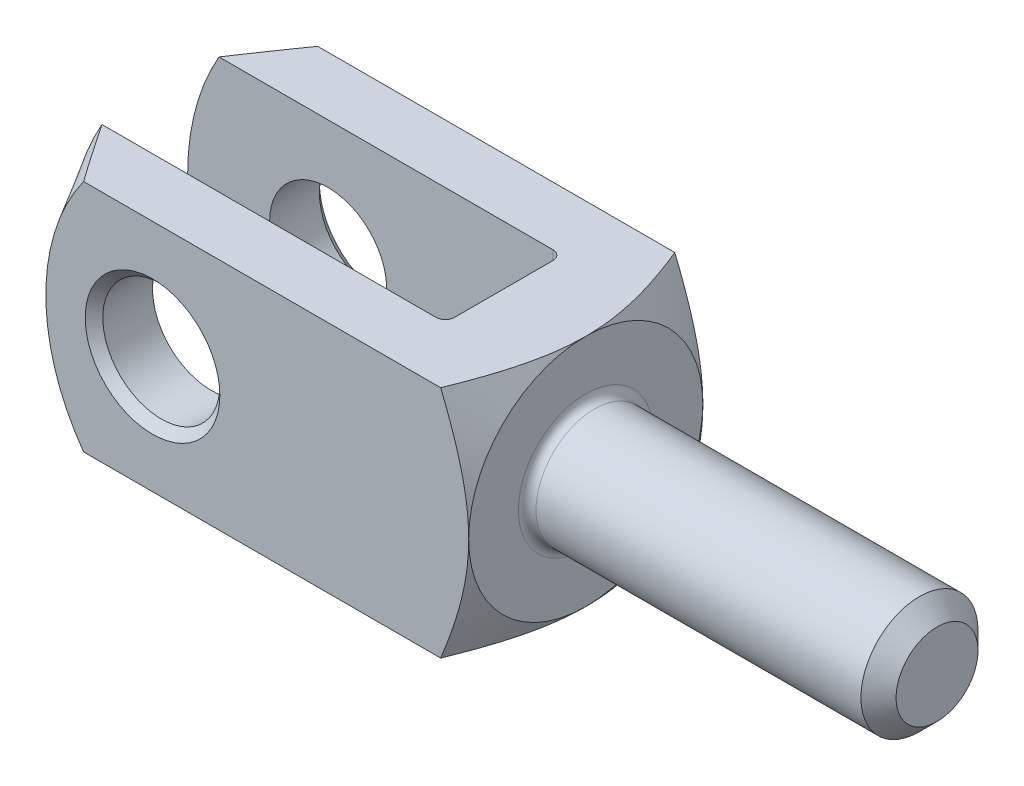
ISO-10303-21;
HEADER;
FILE_DESCRIPTION(('STEP AP214'),'2;1');
FILE_NAME('part.step','',(''),(''),'','','');
FILE_SCHEMA(('AUTOMOTIVE_DESIGN { 1 0 10303 214 1 1 1 1 }'));
ENDSEC;
DATA;
#1=APPLICATION_CONTEXT('core data for automotive mechanical design processes');
#2=APPLICATION_PROTOCOL_DEFINITION('international standard','automotive_design',2000,#1);
#3=PRODUCT_CONTEXT('',#1,'mechanical');
#4=PRODUCT('Part','Part','',(#3));
#5=PRODUCT_RELATED_PRODUCT_CATEGORY('part','',(#4));
#6=PRODUCT_DEFINITION_FORMATION('','',#4);
#7=PRODUCT_DEFINITION_CONTEXT('part definition',#1,'design');
#8=PRODUCT_DEFINITION('design','',#6,#7);
#9=PRODUCT_DEFINITION_SHAPE('','',#8);
#10=(LENGTH_UNIT() NAMED_UNIT(*) SI_UNIT(.MILLI.,.METRE.));
#11=(NAMED_UNIT(*) PLANE_ANGLE_UNIT() SI_UNIT($,.RADIAN.));
#12=(NAMED_UNIT(*) SI_UNIT($,.STERADIAN.) SOLID_ANGLE_UNIT());
#13=UNCERTAINTY_MEASURE_WITH_UNIT(LENGTH_MEASURE(1.E-05),#10,'distance_accuracy_value','');
#14=(GEOMETRIC_REPRESENTATION_CONTEXT(3) GLOBAL_UNCERTAINTY_ASSIGNED_CONTEXT((#13)) GLOBAL_UNIT_ASSIGNED_CONTEXT((#10,
#11,#12)) REPRESENTATION_CONTEXT('',''));
#15=CARTESIAN_POINT('',(0.,0.,0.));
#16=DIRECTION('',(0.,0.,1.));
#17=DIRECTION('',(1.,0.,0.));
#18=AXIS2_PLACEMENT_3D('',#15,#16,#17);
#19=CARTESIAN_POINT('',(-69.,-10.,-4.99999999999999));
#20=DIRECTION('',(0.,0.,-1.));
#21=DIRECTION('',(-1.,0.,0.));
#22=AXIS2_PLACEMENT_3D('',#19,#20,#21);
#23=PLANE('',#22);
#24=CARTESIAN_POINT('',(-57.,0.,-4.99999999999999));
#25=DIRECTION('',(0.,0.,-1.));
#26=DIRECTION('',(-1.,0.,0.));
#27=AXIS2_PLACEMENT_3D('',#24,#25,#26);
#28=CIRCLE('',#27,5.);
#29=CARTESIAN_POINT('',(-62.,0.,-4.99999999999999));
#30=VERTEX_POINT('',#29);
#31=EDGE_CURVE('E160',#30,#30,#28,.F.);
#32=ORIENTED_EDGE('',*,*,#31,.F.);
#33=EDGE_LOOP('',(#32));
#34=FACE_BOUND('',#33,.T.);
#35=DIRECTION('',(-1.,0.,0.));
#36=VECTOR('',#35,1.);
#37=CARTESIAN_POINT('',(-69.,10.,-4.99999999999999));
#38=LINE('',#37,#36);
#39=CARTESIAN_POINT('',(-37.8,10.,-4.99999999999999));
#40=VERTEX_POINT('',#39);
#41=CARTESIAN_POINT('',(-66.3205080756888,10.,-4.99999999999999));
#42=VERTEX_POINT('',#41);
#43=EDGE_CURVE('E321',#40,#42,#38,.T.);
#44=ORIENTED_EDGE('',*,*,#43,.T.);
#45=CARTESIAN_POINT('',(-49.,0.,-4.99999999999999));
#46=DIRECTION('',(0.,0.,1.));
#47=DIRECTION('',(1.,0.,0.));
#48=AXIS2_PLACEMENT_3D('',#45,#46,#47);
#49=CIRCLE('',#48,20.);
#50=CARTESIAN_POINT('',(-66.3205080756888,-10.,-4.99999999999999));
#51=VERTEX_POINT('',#50);
#52=EDGE_CURVE('E61',#42,#51,#49,.T.);
#53=ORIENTED_EDGE('',*,*,#52,.T.);
#54=DIRECTION('',(-1.,0.,0.));
#55=VECTOR('',#54,1.);
#56=CARTESIAN_POINT('',(-69.,-10.,-4.99999999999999));
#57=LINE('',#56,#55);
#58=CARTESIAN_POINT('',(-37.8,-10.,-4.99999999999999));
#59=VERTEX_POINT('',#58);
#60=EDGE_CURVE('E311',#59,#51,#57,.T.);
#61=ORIENTED_EDGE('',*,*,#60,.F.);
#62=DIRECTION('',(0.,1.,0.));
#63=VECTOR('',#62,1.);
#64=CARTESIAN_POINT('',(-37.8,10.,-4.99999999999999));
#65=LINE('',#64,#63);
#66=EDGE_CURVE('E183',#59,#40,#65,.T.);
#67=ORIENTED_EDGE('',*,*,#66,.T.);
#68=EDGE_LOOP('',(#44,#53,#61,#67));
#69=FACE_BOUND('',#68,.T.);
#70=ADVANCED_FACE('F37',(#34,#69),#23,.F.);
#71=CARTESIAN_POINT('',(-69.,-10.,5.00000000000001));
#72=DIRECTION('',(0.,0.,1.));
#73=DIRECTION('',(1.,0.,0.));
#74=AXIS2_PLACEMENT_3D('',#71,#72,#73);
#75=PLANE('',#74);
#76=CARTESIAN_POINT('',(-57.,0.,5.00000000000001));
#77=DIRECTION('',(0.,0.,1.));
#78=DIRECTION('',(1.,0.,0.));
#79=AXIS2_PLACEMENT_3D('',#76,#77,#78);
#80=CIRCLE('',#79,5.);
#81=CARTESIAN_POINT('',(-52.,0.,5.00000000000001));
#82=VERTEX_POINT('',#81);
#83=EDGE_CURVE('E164',#82,#82,#80,.F.);
#84=ORIENTED_EDGE('',*,*,#83,.F.);
#85=EDGE_LOOP('',(#84));
#86=FACE_BOUND('',#85,.T.);
#87=CARTESIAN_POINT('',(-49.,0.,5.00000000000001));
#88=DIRECTION('',(0.,0.,1.));
#89=DIRECTION('',(1.,0.,0.));
#90=AXIS2_PLACEMENT_3D('',#87,#88,#89);
#91=CIRCLE('',#90,20.);
#92=CARTESIAN_POINT('',(-66.3205080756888,10.,5.00000000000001));
#93=VERTEX_POINT('',#92);
#94=CARTESIAN_POINT('',(-66.3205080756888,-10.,5.00000000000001));
#95=VERTEX_POINT('',#94);
#96=EDGE_CURVE('E128',#93,#95,#91,.T.);
#97=ORIENTED_EDGE('',*,*,#96,.F.);
#98=DIRECTION('',(1.,0.,0.));
#99=VECTOR('',#98,1.);
#100=CARTESIAN_POINT('',(-69.,10.,5.00000000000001));
#101=LINE('',#100,#99);
#102=CARTESIAN_POINT('',(-37.8,10.,5.));
#103=VERTEX_POINT('',#102);
#104=EDGE_CURVE('E325',#93,#103,#101,.T.);
#105=ORIENTED_EDGE('',*,*,#104,.T.);
#106=DIRECTION('',(0.,1.,0.));
#107=VECTOR('',#106,1.);
#108=CARTESIAN_POINT('',(-37.8,-10.,5.));
#109=LINE('',#108,#107);
#110=CARTESIAN_POINT('',(-37.8,-10.,5.));
#111=VERTEX_POINT('',#110);
#112=EDGE_CURVE('E179',#103,#111,#109,.F.);
#113=ORIENTED_EDGE('',*,*,#112,.T.);
#114=DIRECTION('',(1.,0.,0.));
#115=VECTOR('',#114,1.);
#116=CARTESIAN_POINT('',(-69.,-10.,5.00000000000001));
#117=LINE('',#116,#115);
#118=EDGE_CURVE('E314',#95,#111,#117,.T.);
#119=ORIENTED_EDGE('',*,*,#118,.F.);
#120=EDGE_LOOP('',(#97,#105,#113,#119));
#121=FACE_BOUND('',#120,.T.);
#122=ADVANCED_FACE('F385',(#86,#121),#75,.F.);
#123=CARTESIAN_POINT('',(-69.,-10.,10.));
#124=DIRECTION('',(0.,0.,1.));
#125=DIRECTION('',(1.,0.,0.));
#126=AXIS2_PLACEMENT_3D('',#123,#124,#125);
#127=PLANE('',#126);
#128=CARTESIAN_POINT('',(-57.,0.,10.));
#129=DIRECTION('',(0.,0.,1.));
#130=DIRECTION('',(1.,0.,0.));
#131=AXIS2_PLACEMENT_3D('',#128,#129,#130);
#132=CIRCLE('',#131,5.75);
#133=CARTESIAN_POINT('',(-51.25,0.,10.));
#134=VERTEX_POINT('',#133);
#135=EDGE_CURVE('E219',#134,#134,#132,.F.);
#136=ORIENTED_EDGE('',*,*,#135,.T.);
#137=EDGE_LOOP('',(#136));
#138=FACE_BOUND('',#137,.T.);
#139=DIRECTION('',(1.,0.,0.));
#140=VECTOR('',#139,1.);
#141=CARTESIAN_POINT('',(-69.,10.,10.));
#142=LINE('',#141,#140);
#143=CARTESIAN_POINT('',(-62.8875224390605,10.,10.));
#144=VERTEX_POINT('',#143);
#145=CARTESIAN_POINT('',(-32.391463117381,10.,10.));
#146=VERTEX_POINT('',#145);
#147=EDGE_CURVE('E142',#144,#146,#142,.T.);
#148=ORIENTED_EDGE('',*,*,#147,.F.);
#149=CARTESIAN_POINT('',(-49.,0.,10.));
#150=DIRECTION('',(0.,0.,1.));
#151=DIRECTION('',(1.,0.,0.));
#152=AXIS2_PLACEMENT_3D('',#149,#150,#151);
#153=CIRCLE('',#152,17.1132486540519);
#154=CARTESIAN_POINT('',(-62.8875224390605,-10.,10.));
#155=VERTEX_POINT('',#154);
#156=EDGE_CURVE('E53',#144,#155,#153,.T.);
#157=ORIENTED_EDGE('',*,*,#156,.T.);
#158=DIRECTION('',(1.,0.,0.));
#159=VECTOR('',#158,1.);
#160=CARTESIAN_POINT('',(-69.,-10.,10.));
#161=LINE('',#160,#159);
#162=CARTESIAN_POINT('',(-32.391463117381,-10.,10.));
#163=VERTEX_POINT('',#162);
#164=EDGE_CURVE('E139',#155,#163,#161,.T.);
#165=ORIENTED_EDGE('',*,*,#164,.T.);
#166=CARTESIAN_POINT('',(-37.3558734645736,-20.4240435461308,10.));
#167=CARTESIAN_POINT('',(-37.1003465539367,-19.9311836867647,10.));
#168=CARTESIAN_POINT('',(-36.8461705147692,-19.4376169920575,10.));
#169=CARTESIAN_POINT('',(-36.3412365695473,-18.4487061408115,10.));
#170=CARTESIAN_POINT('',(-36.0904788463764,-17.9533618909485,10.));
#171=CARTESIAN_POINT('',(-35.5926922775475,-16.9597202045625,10.));
#172=CARTESIAN_POINT('',(-35.3456706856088,-16.4614191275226,10.));
#173=CARTESIAN_POINT('',(-34.8568264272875,-15.4622801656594,10.));
#174=CARTESIAN_POINT('',(-34.6150036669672,-14.9614423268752,10.));
#175=CARTESIAN_POINT('',(-34.1232043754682,-13.9257515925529,10.));
#176=CARTESIAN_POINT('',(-33.8736415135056,-13.3907016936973,10.));
#177=CARTESIAN_POINT('',(-33.3840144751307,-12.3162208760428,10.));
#178=CARTESIAN_POINT('',(-33.1439507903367,-11.7767897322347,10.));
#179=CARTESIAN_POINT('',(-32.6764473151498,-10.6927476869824,10.));
#180=CARTESIAN_POINT('',(-32.4490019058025,-10.1481392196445,10.));
#181=CARTESIAN_POINT('',(-32.0108100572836,-9.05224110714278,10.));
#182=CARTESIAN_POINT('',(-31.8000616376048,-8.50095226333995,10.));
#183=CARTESIAN_POINT('',(-31.4792530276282,-7.60769970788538,10.));
#184=CARTESIAN_POINT('',(-31.3620787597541,-7.26829451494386,10.));
#185=CARTESIAN_POINT('',(-31.1378183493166,-6.58617800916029,10.));
#186=CARTESIAN_POINT('',(-31.0307313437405,-6.24346698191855,10.));
#187=CARTESIAN_POINT('',(-30.828626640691,-5.55448777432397,10.));
#188=CARTESIAN_POINT('',(-30.733608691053,-5.2082196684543,10.));
#189=CARTESIAN_POINT('',(-30.5579131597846,-4.51203468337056,10.));
#190=CARTESIAN_POINT('',(-30.4772354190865,-4.16211784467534,10.));
#191=CARTESIAN_POINT('',(-30.3343492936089,-3.46705706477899,10.));
#192=CARTESIAN_POINT('',(-30.2717518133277,-3.12199390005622,10.));
#193=CARTESIAN_POINT('',(-30.1647579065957,-2.42903327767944,10.));
#194=CARTESIAN_POINT('',(-30.1203608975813,-2.0811359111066,10.));
#195=CARTESIAN_POINT('',(-30.0516237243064,-1.38356903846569,10.));
#196=CARTESIAN_POINT('',(-30.0272704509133,-1.03390084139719,10.));
#197=CARTESIAN_POINT('',(-29.9996951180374,-0.333728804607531,10.));
#198=CARTESIAN_POINT('',(-29.9964723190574,0.0167750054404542,10.));
#199=CARTESIAN_POINT('',(-30.010762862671,0.691790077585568,10.));
#200=CARTESIAN_POINT('',(-30.0267823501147,1.01633432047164,10.));
#201=CARTESIAN_POINT('',(-30.0764553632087,1.66405607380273,10.));
#202=CARTESIAN_POINT('',(-30.1101088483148,1.98723358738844,10.));
#203=CARTESIAN_POINT('',(-30.1938161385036,2.63160306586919,10.));
#204=CARTESIAN_POINT('',(-30.2438784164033,2.95279391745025,10.));
#205=CARTESIAN_POINT('',(-30.3587527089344,3.59250988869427,10.));
#206=CARTESIAN_POINT('',(-30.4235651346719,3.91103493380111,10.));
#207=CARTESIAN_POINT('',(-30.5682001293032,4.55432870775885,10.));
#208=CARTESIAN_POINT('',(-30.648402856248,4.87901130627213,10.));
#209=CARTESIAN_POINT('',(-30.8205817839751,5.525218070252,10.));
#210=CARTESIAN_POINT('',(-30.9125580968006,5.84674220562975,10.));
#211=CARTESIAN_POINT('',(-31.1065044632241,6.48673250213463,10.));
#212=CARTESIAN_POINT('',(-31.2084740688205,6.80519879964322,10.));
#213=CARTESIAN_POINT('',(-31.3677555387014,7.28075232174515,10.));
#214=CARTESIAN_POINT('',(-31.4219029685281,7.43891003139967,10.));
#215=CARTESIAN_POINT('',(-31.5321392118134,7.75454715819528,10.));
#216=CARTESIAN_POINT('',(-31.5882280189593,7.91202657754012,10.));
#217=CARTESIAN_POINT('',(-31.7684482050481,8.40910944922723,10.));
#218=CARTESIAN_POINT('',(-31.8958517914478,8.74752927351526,10.));
#219=CARTESIAN_POINT('',(-32.1575763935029,9.42169147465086,10.));
#220=CARTESIAN_POINT('',(-32.2918978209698,9.75743369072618,10.));
#221=CARTESIAN_POINT('',(-32.5663381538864,10.4266152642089,10.));
#222=CARTESIAN_POINT('',(-32.7064582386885,10.7600541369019,10.));
#223=CARTESIAN_POINT('',(-32.9915396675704,11.4248600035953,10.));
#224=CARTESIAN_POINT('',(-33.1365011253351,11.7562269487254,10.));
#225=CARTESIAN_POINT('',(-33.4306248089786,12.4174211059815,10.));
#226=CARTESIAN_POINT('',(-33.579790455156,12.7472467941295,10.));
#227=CARTESIAN_POINT('',(-33.8815899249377,13.4053092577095,10.));
#228=CARTESIAN_POINT('',(-34.0342237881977,13.7335460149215,10.));
#229=CARTESIAN_POINT('',(-34.496500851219,14.7160981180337,10.));
#230=CARTESIAN_POINT('',(-34.8105565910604,15.3683378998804,10.));
#231=CARTESIAN_POINT('',(-35.4483163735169,16.670528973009,10.));
#232=CARTESIAN_POINT('',(-35.7720469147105,17.3204672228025,10.));
#233=CARTESIAN_POINT('',(-36.4261391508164,18.6170111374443,10.));
#234=CARTESIAN_POINT('',(-36.7565009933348,19.2636167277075,10.));
#235=CARTESIAN_POINT('',(-37.4221745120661,20.5538665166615,10.));
#236=CARTESIAN_POINT('',(-37.7574836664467,21.197512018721,10.));
#237=CARTESIAN_POINT('',(-38.4321254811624,22.4826820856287,10.));
#238=CARTESIAN_POINT('',(-38.7714581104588,23.1242066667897,10.));
#239=CARTESIAN_POINT('',(-39.6929935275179,24.8559334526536,10.));
#240=CARTESIAN_POINT('',(-40.2782369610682,25.9445168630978,10.));
#241=CARTESIAN_POINT('',(-41.4553238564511,28.1183008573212,10.));
#242=CARTESIAN_POINT('',(-42.0471682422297,29.2035009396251,10.));
#243=CARTESIAN_POINT('',(-43.232230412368,31.3650726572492,10.));
#244=CARTESIAN_POINT('',(-43.8254209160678,32.4414592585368,10.));
#245=CARTESIAN_POINT('',(-44.7178280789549,34.0544764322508,10.));
#246=CARTESIAN_POINT('',(-45.0157104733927,34.5918461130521,10.));
#247=CARTESIAN_POINT('',(-45.6122603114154,35.6661487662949,10.));
#248=CARTESIAN_POINT('',(-45.9109277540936,36.2030817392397,10.));
#249=CARTESIAN_POINT('',(-46.2099360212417,36.7398248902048,10.));
#250=B_SPLINE_CURVE_WITH_KNOTS('',3,(#166,#167,#168,#169,#170,#171,#172,#173,#174,#175,#176,
#177,#178,#179,#180,#181,#182,#183,#184,#185,#186,#187,#188,#189,#190,#191,#192,#193,#194,#195,
#196,#197,#198,#199,#200,#201,#202,#203,#204,#205,#206,#207,#208,#209,#210,#211,#212,#213,#214,
#215,#216,#217,#218,#219,#220,#221,#222,#223,#224,#225,#226,#227,#228,#229,#230,#231,#232,#233,
#234,#235,#236,#237,#238,#239,#240,#241,#242,#243,#244,#245,#246,#247,#248,#249),.UNSPECIFIED.,
.F.,.F.,(4,2,2,2,2,2,2,2,2,2,2,2,2,2,2,2,2,2,2,2,2,2,2,2,2,2,2,2,2,2,2,2,2,2,2,2,2,2,2,2,2,4),
(0.,1.66549246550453,3.33107368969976,4.99955529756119,6.66800673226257,8.43910594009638,
10.2102966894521,11.980692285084,13.7508775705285,14.8279395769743,15.9049093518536,
16.9818566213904,18.0587919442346,19.1104471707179,20.162068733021,21.2130019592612,
22.2638984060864,23.2382198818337,24.2125391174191,25.1873622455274,26.1622125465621,
27.1652790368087,28.1683550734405,29.1713861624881,29.6728858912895,30.1743839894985,
31.2591028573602,32.3438863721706,33.4288916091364,34.5139223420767,35.59986283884,
36.6858157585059,38.8574500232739,41.0357057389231,43.214009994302,45.3912398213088,
47.5684528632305,51.2762079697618,54.9844887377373,58.6715305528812,60.5147611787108,
62.3579896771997),.UNSPECIFIED.);
#251=CARTESIAN_POINT('',(-30.,0.,10.));
#252=VERTEX_POINT('',#251);
#253=EDGE_CURVE('E283',#252,#163,#250,.F.);
#254=ORIENTED_EDGE('',*,*,#253,.F.);
#255=EDGE_CURVE('E281',#146,#252,#250,.F.);
#256=ORIENTED_EDGE('',*,*,#255,.F.);
#257=EDGE_LOOP('',(#148,#157,#165,#254,#256));
#258=FACE_BOUND('',#257,.T.);
#259=ADVANCED_FACE('F137',(#138,#258),#127,.T.);
#260=CARTESIAN_POINT('',(-69.,-10.,10.));
#261=DIRECTION('',(0.,-1.,0.));
#262=DIRECTION('',(0.,0.,-1.));
#263=AXIS2_PLACEMENT_3D('',#260,#261,#262);
#264=PLANE('',#263);
#265=ORIENTED_EDGE('',*,*,#60,.T.);
#266=CARTESIAN_POINT('',(-74.2321898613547,-10.,7.36951687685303));
#267=CARTESIAN_POINT('',(-73.745633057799,-10.,6.58611648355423));
#268=CARTESIAN_POINT('',(-73.2577437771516,-10.,5.80353993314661));
#269=CARTESIAN_POINT('',(-72.2786767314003,-10.,4.24042523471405));
#270=CARTESIAN_POINT('',(-71.7874989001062,-10.,3.45988712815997));
#271=CARTESIAN_POINT('',(-70.8006621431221,-10.,1.90034138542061));
#272=CARTESIAN_POINT('',(-70.3049985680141,-10.,1.12133668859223));
#273=CARTESIAN_POINT('',(-69.3089364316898,-10.,-0.433632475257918));
#274=CARTESIAN_POINT('',(-68.8085379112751,-10.,-1.20959696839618));
#275=CARTESIAN_POINT('',(-67.7809631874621,-10.,-2.78997730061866));
#276=CARTESIAN_POINT('',(-67.2535395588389,-10.,-3.59423250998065));
#277=CARTESIAN_POINT('',(-66.1907284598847,-10.,-5.19745714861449));
#278=CARTESIAN_POINT('',(-65.6553410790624,-10.,-5.99642663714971));
#279=CARTESIAN_POINT('',(-64.5747096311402,-10.,-7.58683469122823));
#280=CARTESIAN_POINT('',(-64.0294731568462,-10.,-8.37827839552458));
#281=CARTESIAN_POINT('',(-63.2014533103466,-10.,-9.55828753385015));
#282=CARTESIAN_POINT('',(-62.9237578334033,-10.,-9.95042385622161));
#283=CARTESIAN_POINT('',(-62.3644017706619,-10.,-10.7318561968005));
#284=CARTESIAN_POINT('',(-62.0827412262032,-10.,-11.1211522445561));
#285=CARTESIAN_POINT('',(-61.5174190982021,-10.,-11.8927308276));
#286=CARTESIAN_POINT('',(-61.2338006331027,-10.,-12.2750449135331));
#287=CARTESIAN_POINT('',(-60.6611630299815,-10.,-13.0356258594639));
#288=CARTESIAN_POINT('',(-60.3721437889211,-10.,-13.4138926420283));
#289=CARTESIAN_POINT('',(-59.787258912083,-10.,-14.1659406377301));
#290=CARTESIAN_POINT('',(-59.4913844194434,-10.,-14.5397149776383));
#291=CARTESIAN_POINT('',(-58.8918382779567,-10.,-15.2809455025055));
#292=CARTESIAN_POINT('',(-58.5881670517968,-10.,-15.6484020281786));
#293=CARTESIAN_POINT('',(-57.9744614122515,-10.,-16.3714518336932));
#294=CARTESIAN_POINT('',(-57.6645256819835,-10.,-16.7271286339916));
#295=CARTESIAN_POINT('',(-57.0329680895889,-10.,-17.4282054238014));
#296=CARTESIAN_POINT('',(-56.7113432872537,-10.,-17.7736027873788));
#297=CARTESIAN_POINT('',(-56.2183551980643,-10.,-18.2807263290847));
#298=CARTESIAN_POINT('',(-56.0524514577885,-10.,-18.4477649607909));
#299=CARTESIAN_POINT('',(-55.716558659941,-10.,-18.7776754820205));
#300=CARTESIAN_POINT('',(-55.5465698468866,-10.,-18.9405476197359));
#301=CARTESIAN_POINT('',(-55.2020749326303,-10.,-19.2612725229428));
#302=CARTESIAN_POINT('',(-55.0275712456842,-10.,-19.4191278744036));
#303=CARTESIAN_POINT('',(-54.6733935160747,-10.,-19.7289072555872));
#304=CARTESIAN_POINT('',(-54.4937200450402,-10.,-19.8808319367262));
#305=CARTESIAN_POINT('',(-54.1220498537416,-10.,-20.1827912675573));
#306=CARTESIAN_POINT('',(-53.9298420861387,-10.,-20.3325675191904));
#307=CARTESIAN_POINT('',(-53.538357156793,-10.,-20.6227066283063));
#308=CARTESIAN_POINT('',(-53.3390786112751,-10.,-20.7630676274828));
#309=CARTESIAN_POINT('',(-52.9328460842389,-10.,-21.0319774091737));
#310=CARTESIAN_POINT('',(-52.7258982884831,-10.,-21.160535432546));
#311=CARTESIAN_POINT('',(-52.3037021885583,-10.,-21.4030294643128));
#312=CARTESIAN_POINT('',(-52.0884560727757,-10.,-21.5169692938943));
#313=CARTESIAN_POINT('',(-51.5296464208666,-10.,-21.7838098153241));
#314=CARTESIAN_POINT('',(-51.1798259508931,-10.,-21.9243079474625));
#315=CARTESIAN_POINT('',(-50.6418795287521,-10.,-22.0912640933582));
#316=CARTESIAN_POINT('',(-50.4604354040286,-10.,-22.1396072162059));
#317=CARTESIAN_POINT('',(-50.0939159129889,-10.,-22.2200235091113));
#318=CARTESIAN_POINT('',(-49.908840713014,-10.,-22.2520974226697));
#319=CARTESIAN_POINT('',(-49.5346022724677,-10.,-22.2988166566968));
#320=CARTESIAN_POINT('',(-49.3454166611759,-10.,-22.313284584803));
#321=CARTESIAN_POINT('',(-48.9665401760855,-10.,-22.3235178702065));
#322=CARTESIAN_POINT('',(-48.7768493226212,-10.,-22.3192839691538));
#323=CARTESIAN_POINT('',(-48.3987646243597,-10.,-22.292316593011));
#324=CARTESIAN_POINT('',(-48.2103710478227,-10.,-22.2695794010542));
#325=CARTESIAN_POINT('',(-47.8365348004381,-10.,-22.2066526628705));
#326=CARTESIAN_POINT('',(-47.6510925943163,-10.,-22.1664603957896));
#327=CARTESIAN_POINT('',(-47.2504201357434,-10.,-22.0613497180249));
#328=CARTESIAN_POINT('',(-47.0360329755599,-10.,-21.9932307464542));
#329=CARTESIAN_POINT('',(-46.6142317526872,-10.,-21.8379822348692));
#330=CARTESIAN_POINT('',(-46.4068216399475,-10.,-21.750842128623));
#331=CARTESIAN_POINT('',(-45.9988371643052,-10.,-21.5605082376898));
#332=CARTESIAN_POINT('',(-45.7982845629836,-10.,-21.4572682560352));
#333=CARTESIAN_POINT('',(-45.4045157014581,-10.,-21.2378022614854));
#334=CARTESIAN_POINT('',(-45.2112986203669,-10.,-21.121577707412));
#335=CARTESIAN_POINT('',(-44.7694245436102,-10.,-20.83866105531));
#336=CARTESIAN_POINT('',(-44.5233696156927,-10.,-20.667919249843));
#337=CARTESIAN_POINT('',(-44.0418236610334,-10.,-20.3120669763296));
#338=CARTESIAN_POINT('',(-43.8063377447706,-10.,-20.1269496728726));
#339=CARTESIAN_POINT('',(-43.3441491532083,-10.,-19.7452386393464));
#340=CARTESIAN_POINT('',(-43.1174642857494,-10.,-19.5486234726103));
#341=CARTESIAN_POINT('',(-42.6720928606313,-10.,-19.1466530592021));
#342=CARTESIAN_POINT('',(-42.4534049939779,-10.,-18.9412992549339));
#343=CARTESIAN_POINT('',(-42.0214181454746,-10.,-18.5221818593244));
#344=CARTESIAN_POINT('',(-41.8081650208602,-10.,-18.3083711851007));
#345=CARTESIAN_POINT('',(-41.3876033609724,-10.,-17.8749857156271));
#346=CARTESIAN_POINT('',(-41.1802950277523,-10.,-17.6554107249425));
#347=CARTESIAN_POINT('',(-40.7710307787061,-10.,-17.2117611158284));
#348=CARTESIAN_POINT('',(-40.5690695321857,-10.,-16.9876914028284));
#349=CARTESIAN_POINT('',(-40.1696072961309,-10.,-16.5356277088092));
#350=CARTESIAN_POINT('',(-39.972106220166,-10.,-16.3076338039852));
#351=CARTESIAN_POINT('',(-39.4999897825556,-10.,-15.7532280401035));
#352=CARTESIAN_POINT('',(-39.2273152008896,-10.,-15.4251642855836));
#353=CARTESIAN_POINT('',(-38.6883836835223,-10.,-14.7637172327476));
#354=CARTESIAN_POINT('',(-38.4221280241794,-10.,-14.43033289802));
#355=CARTESIAN_POINT('',(-37.899094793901,-10.,-13.7644395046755));
#356=CARTESIAN_POINT('',(-37.6422345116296,-10.,-13.4319952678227));
#357=CARTESIAN_POINT('',(-37.1331161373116,-10.,-12.7637580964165));
#358=CARTESIAN_POINT('',(-36.8808566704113,-10.,-12.4279662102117));
#359=CARTESIAN_POINT('',(-36.6304831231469,-10.,-12.0907921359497));
#360=B_SPLINE_CURVE_WITH_KNOTS('',3,(#266,#267,#268,#269,#270,#271,#272,#273,#274,#275,#276,
#277,#278,#279,#280,#281,#282,#283,#284,#285,#286,#287,#288,#289,#290,#291,#292,#293,#294,#295,
#296,#297,#298,#299,#300,#301,#302,#303,#304,#305,#306,#307,#308,#309,#310,#311,#312,#313,#314,
#315,#316,#317,#318,#319,#320,#321,#322,#323,#324,#325,#326,#327,#328,#329,#330,#331,#332,#333,
#334,#335,#336,#337,#338,#339,#340,#341,#342,#343,#344,#345,#346,#347,#348,#349,#350,#351,#352,
#353,#354,#355,#356,#357,#358,#359),.UNSPECIFIED.,.F.,.F.,(4,2,2,2,2,2,2,2,2,2,2,2,2,2,2,2,2,2,
2,2,2,2,2,2,2,2,2,2,2,2,2,2,2,2,2,2,2,2,2,2,2,2,2,2,2,2,4),(0.,2.7666047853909,5.53326542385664,
8.30322881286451,11.0731683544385,13.9584410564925,16.8436813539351,19.7267850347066,
21.1682825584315,22.6097650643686,24.0378123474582,25.465886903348,26.8959225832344,
28.3258808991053,29.7410059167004,31.1564893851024,31.862713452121,32.5688953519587,
33.2747071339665,33.9804411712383,34.7112197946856,35.4421422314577,36.1724874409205,
36.9026413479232,38.0289522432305,38.5916651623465,39.1543523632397,39.7226632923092,
40.2909516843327,40.8593542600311,41.427845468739,42.1016117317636,42.7757532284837,
43.4518659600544,44.1279028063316,45.0256730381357,45.9238727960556,46.8238041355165,
47.7235875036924,48.6293923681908,49.5352279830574,50.4401236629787,51.345001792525,
52.6246585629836,53.9045677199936,55.164870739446,56.4247907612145),.UNSPECIFIED.);
#361=CARTESIAN_POINT('',(-62.8875224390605,-10.,-10.));
#362=VERTEX_POINT('',#361);
#363=EDGE_CURVE('E133',#51,#362,#360,.T.);
#364=ORIENTED_EDGE('',*,*,#363,.T.);
#365=DIRECTION('',(1.,0.,0.));
#366=VECTOR('',#365,1.);
#367=CARTESIAN_POINT('',(-69.,-10.,-10.));
#368=LINE('',#367,#366);
#369=CARTESIAN_POINT('',(-32.391463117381,-10.,-10.));
#370=VERTEX_POINT('',#369);
#371=EDGE_CURVE('E152',#362,#370,#368,.T.);
#372=ORIENTED_EDGE('',*,*,#371,.T.);
#373=CARTESIAN_POINT('',(-37.3558734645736,-10.,-20.4240435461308));
#374=CARTESIAN_POINT('',(-37.1003465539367,-10.,-19.9311836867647));
#375=CARTESIAN_POINT('',(-36.8461705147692,-10.,-19.4376169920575));
#376=CARTESIAN_POINT('',(-36.3412365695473,-10.,-18.4487061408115));
#377=CARTESIAN_POINT('',(-36.0904788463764,-10.,-17.9533618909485));
#378=CARTESIAN_POINT('',(-35.5926922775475,-10.,-16.9597202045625));
#379=CARTESIAN_POINT('',(-35.3456706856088,-10.,-16.4614191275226));
#380=CARTESIAN_POINT('',(-34.8568264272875,-10.,-15.4622801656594));
#381=CARTESIAN_POINT('',(-34.6150036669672,-10.,-14.9614423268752));
#382=CARTESIAN_POINT('',(-34.1232043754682,-10.,-13.9257515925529));
#383=CARTESIAN_POINT('',(-33.8736415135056,-10.,-13.3907016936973));
#384=CARTESIAN_POINT('',(-33.3840144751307,-10.,-12.3162208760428));
#385=CARTESIAN_POINT('',(-33.1439507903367,-10.,-11.7767897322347));
#386=CARTESIAN_POINT('',(-32.6764473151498,-10.,-10.6927476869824));
#387=CARTESIAN_POINT('',(-32.4490019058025,-10.,-10.1481392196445));
#388=CARTESIAN_POINT('',(-32.0108100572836,-10.,-9.05224110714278));
#389=CARTESIAN_POINT('',(-31.8000616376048,-10.,-8.50095226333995));
#390=CARTESIAN_POINT('',(-31.4792530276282,-10.,-7.60769970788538));
#391=CARTESIAN_POINT('',(-31.3620787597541,-10.,-7.26829451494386));
#392=CARTESIAN_POINT('',(-31.1378183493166,-10.,-6.58617800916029));
#393=CARTESIAN_POINT('',(-31.0307313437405,-10.,-6.24346698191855));
#394=CARTESIAN_POINT('',(-30.828626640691,-10.,-5.55448777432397));
#395=CARTESIAN_POINT('',(-30.733608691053,-10.,-5.2082196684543));
#396=CARTESIAN_POINT('',(-30.5579131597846,-10.,-4.51203468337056));
#397=CARTESIAN_POINT('',(-30.4772354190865,-10.,-4.16211784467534));
#398=CARTESIAN_POINT('',(-30.3343492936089,-10.,-3.46705706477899));
#399=CARTESIAN_POINT('',(-30.2717518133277,-10.,-3.12199390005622));
#400=CARTESIAN_POINT('',(-30.1647579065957,-10.,-2.42903327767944));
#401=CARTESIAN_POINT('',(-30.1203608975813,-10.,-2.0811359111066));
#402=CARTESIAN_POINT('',(-30.0516237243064,-10.,-1.38356903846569));
#403=CARTESIAN_POINT('',(-30.0272704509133,-10.,-1.03390084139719));
#404=CARTESIAN_POINT('',(-29.9996951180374,-10.,-0.333728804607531));
#405=CARTESIAN_POINT('',(-29.9964723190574,-10.,0.0167750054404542));
#406=CARTESIAN_POINT('',(-30.010762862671,-10.,0.691790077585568));
#407=CARTESIAN_POINT('',(-30.0267823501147,-10.,1.01633432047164));
#408=CARTESIAN_POINT('',(-30.0764553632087,-10.,1.66405607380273));
#409=CARTESIAN_POINT('',(-30.1101088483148,-10.,1.98723358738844));
#410=CARTESIAN_POINT('',(-30.1938161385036,-10.,2.63160306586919));
#411=CARTESIAN_POINT('',(-30.2438784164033,-10.,2.95279391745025));
#412=CARTESIAN_POINT('',(-30.3587527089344,-10.,3.59250988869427));
#413=CARTESIAN_POINT('',(-30.4235651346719,-10.,3.91103493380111));
#414=CARTESIAN_POINT('',(-30.5682001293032,-10.,4.55432870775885));
#415=CARTESIAN_POINT('',(-30.648402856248,-10.,4.87901130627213));
#416=CARTESIAN_POINT('',(-30.8205817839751,-10.,5.525218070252));
#417=CARTESIAN_POINT('',(-30.9125580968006,-10.,5.84674220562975));
#418=CARTESIAN_POINT('',(-31.1065044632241,-10.,6.48673250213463));
#419=CARTESIAN_POINT('',(-31.2084740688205,-10.,6.80519879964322));
#420=CARTESIAN_POINT('',(-31.3677555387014,-10.,7.28075232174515));
#421=CARTESIAN_POINT('',(-31.4219029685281,-10.,7.43891003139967));
#422=CARTESIAN_POINT('',(-31.5321392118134,-10.,7.75454715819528));
#423=CARTESIAN_POINT('',(-31.5882280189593,-10.,7.91202657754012));
#424=CARTESIAN_POINT('',(-31.7684482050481,-10.,8.40910944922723));
#425=CARTESIAN_POINT('',(-31.8958517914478,-10.,8.74752927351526));
#426=CARTESIAN_POINT('',(-32.1575763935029,-10.,9.42169147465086));
#427=CARTESIAN_POINT('',(-32.2918978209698,-10.,9.75743369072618));
#428=CARTESIAN_POINT('',(-32.5663381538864,-10.,10.4266152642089));
#429=CARTESIAN_POINT('',(-32.7064582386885,-10.,10.7600541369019));
#430=CARTESIAN_POINT('',(-32.9915396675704,-10.,11.4248600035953));
#431=CARTESIAN_POINT('',(-33.1365011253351,-10.,11.7562269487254));
#432=CARTESIAN_POINT('',(-33.4306248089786,-10.,12.4174211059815));
#433=CARTESIAN_POINT('',(-33.579790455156,-10.,12.7472467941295));
#434=CARTESIAN_POINT('',(-33.8815899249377,-10.,13.4053092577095));
#435=CARTESIAN_POINT('',(-34.0342237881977,-10.,13.7335460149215));
#436=CARTESIAN_POINT('',(-34.496500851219,-10.,14.7160981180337));
#437=CARTESIAN_POINT('',(-34.8105565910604,-10.,15.3683378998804));
#438=CARTESIAN_POINT('',(-35.4483163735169,-10.,16.670528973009));
#439=CARTESIAN_POINT('',(-35.7720469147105,-10.,17.3204672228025));
#440=CARTESIAN_POINT('',(-36.4261391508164,-10.,18.6170111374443));
#441=CARTESIAN_POINT('',(-36.7565009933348,-10.,19.2636167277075));
#442=CARTESIAN_POINT('',(-37.4221745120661,-10.,20.5538665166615));
#443=CARTESIAN_POINT('',(-37.7574836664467,-10.,21.197512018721));
#444=CARTESIAN_POINT('',(-38.4321254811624,-10.,22.4826820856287));
#445=CARTESIAN_POINT('',(-38.7714581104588,-10.,23.1242066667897));
#446=CARTESIAN_POINT('',(-39.6929935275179,-10.,24.8559334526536));
#447=CARTESIAN_POINT('',(-40.2782369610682,-10.,25.9445168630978));
#448=CARTESIAN_POINT('',(-41.4553238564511,-10.,28.1183008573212));
#449=CARTESIAN_POINT('',(-42.0471682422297,-10.,29.2035009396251));
#450=CARTESIAN_POINT('',(-43.232230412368,-10.,31.3650726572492));
#451=CARTESIAN_POINT('',(-43.8254209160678,-10.,32.4414592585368));
#452=CARTESIAN_POINT('',(-44.7178280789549,-10.,34.0544764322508));
#453=CARTESIAN_POINT('',(-45.0157104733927,-10.,34.5918461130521));
#454=CARTESIAN_POINT('',(-45.6122603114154,-10.,35.6661487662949));
#455=CARTESIAN_POINT('',(-45.9109277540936,-10.,36.2030817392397));
#456=CARTESIAN_POINT('',(-46.2099360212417,-10.,36.7398248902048));
#457=B_SPLINE_CURVE_WITH_KNOTS('',3,(#373,#374,#375,#376,#377,#378,#379,#380,#381,#382,#383,
#384,#385,#386,#387,#388,#389,#390,#391,#392,#393,#394,#395,#396,#397,#398,#399,#400,#401,#402,
#403,#404,#405,#406,#407,#408,#409,#410,#411,#412,#413,#414,#415,#416,#417,#418,#419,#420,#421,
#422,#423,#424,#425,#426,#427,#428,#429,#430,#431,#432,#433,#434,#435,#436,#437,#438,#439,#440,
#441,#442,#443,#444,#445,#446,#447,#448,#449,#450,#451,#452,#453,#454,#455,#456),.UNSPECIFIED.,
.F.,.F.,(4,2,2,2,2,2,2,2,2,2,2,2,2,2,2,2,2,2,2,2,2,2,2,2,2,2,2,2,2,2,2,2,2,2,2,2,2,2,2,2,2,4),
(0.,1.66549246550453,3.33107368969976,4.99955529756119,6.66800673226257,8.43910594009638,
10.2102966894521,11.980692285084,13.7508775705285,14.8279395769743,15.9049093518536,
16.9818566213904,18.0587919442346,19.1104471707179,20.162068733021,21.2130019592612,
22.2638984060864,23.2382198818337,24.2125391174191,25.1873622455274,26.1622125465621,
27.1652790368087,28.1683550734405,29.1713861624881,29.6728858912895,30.1743839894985,
31.2591028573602,32.3438863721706,33.4288916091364,34.5139223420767,35.59986283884,
36.6858157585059,38.8574500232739,41.0357057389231,43.214009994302,45.3912398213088,
47.5684528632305,51.2762079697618,54.9844887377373,58.6715305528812,60.5147611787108,
62.3579896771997),.UNSPECIFIED.);
#458=CARTESIAN_POINT('',(-30.,-10.,0.));
#459=VERTEX_POINT('',#458);
#460=EDGE_CURVE('E282',#459,#370,#457,.F.);
#461=ORIENTED_EDGE('',*,*,#460,.F.);
#462=EDGE_CURVE('E150',#163,#459,#457,.F.);
#463=ORIENTED_EDGE('',*,*,#462,.F.);
#464=ORIENTED_EDGE('',*,*,#164,.F.);
#465=CARTESIAN_POINT('',(-36.6304831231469,-10.,12.0907921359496));
#466=CARTESIAN_POINT('',(-36.8338762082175,-10.,12.3647242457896));
#467=CARTESIAN_POINT('',(-37.0385262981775,-10.,12.6377302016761));
#468=CARTESIAN_POINT('',(-37.4507369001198,-10.,13.181565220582));
#469=CARTESIAN_POINT('',(-37.6582976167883,-10.,13.4523941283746));
#470=CARTESIAN_POINT('',(-38.0770682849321,-10.,13.9919897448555));
#471=CARTESIAN_POINT('',(-38.2882840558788,-10.,14.2607519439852));
#472=CARTESIAN_POINT('',(-38.7144777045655,-10.,14.7952707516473));
#473=CARTESIAN_POINT('',(-38.9294554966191,-10.,15.0610274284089));
#474=CARTESIAN_POINT('',(-39.3658843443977,-10.,15.5915807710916));
#475=CARTESIAN_POINT('',(-39.5873782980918,-10.,15.8563422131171));
#476=CARTESIAN_POINT('',(-40.0354910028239,-10.,16.3814896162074));
#477=CARTESIAN_POINT('',(-40.2621096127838,-10.,16.6418756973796));
#478=CARTESIAN_POINT('',(-40.7211922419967,-10.,17.1571482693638));
#479=CARTESIAN_POINT('',(-40.9536523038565,-10.,17.4120382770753));
#480=CARTESIAN_POINT('',(-41.4255997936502,-10.,17.9152070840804));
#481=CARTESIAN_POINT('',(-41.665086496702,-10.,18.163486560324));
#482=CARTESIAN_POINT('',(-42.113968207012,-10.,18.6132180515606));
#483=CARTESIAN_POINT('',(-42.3221499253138,-10.,18.8158782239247));
#484=CARTESIAN_POINT('',(-42.7454021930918,-10.,19.2139465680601));
#485=CARTESIAN_POINT('',(-42.9604733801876,-10.,19.4093540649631));
#486=CARTESIAN_POINT('',(-43.3987029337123,-10.,19.7911821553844));
#487=CARTESIAN_POINT('',(-43.6218657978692,-10.,19.9775976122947));
#488=CARTESIAN_POINT('',(-44.0773953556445,-10.,20.3388644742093));
#489=CARTESIAN_POINT('',(-44.3097609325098,-10.,20.5137172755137));
#490=CARTESIAN_POINT('',(-44.7515604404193,-10.,20.8249743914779));
#491=CARTESIAN_POINT('',(-44.9596155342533,-10.,20.9633255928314));
#492=CARTESIAN_POINT('',(-45.3843394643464,-10.,21.2263210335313));
#493=CARTESIAN_POINT('',(-45.6010095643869,-10.,21.3509632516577));
#494=CARTESIAN_POINT('',(-46.0427392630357,-10.,21.5826745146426));
#495=CARTESIAN_POINT('',(-46.2677692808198,-10.,21.6897994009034));
#496=CARTESIAN_POINT('',(-46.7267727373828,-10.,21.8827967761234));
#497=CARTESIAN_POINT('',(-46.9607405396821,-10.,21.9686824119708));
#498=CARTESIAN_POINT('',(-47.3615778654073,-10.,22.0917690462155));
#499=CARTESIAN_POINT('',(-47.5263625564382,-10.,22.1357833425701));
#500=CARTESIAN_POINT('',(-47.8589152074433,-10.,22.2104461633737));
#501=CARTESIAN_POINT('',(-48.0266821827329,-10.,22.2410990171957));
#502=CARTESIAN_POINT('',(-48.3641457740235,-10.,22.2879722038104));
#503=CARTESIAN_POINT('',(-48.5338413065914,-10.,22.3042002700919));
#504=CARTESIAN_POINT('',(-48.8740129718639,-10.,22.3216361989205));
#505=CARTESIAN_POINT('',(-49.0444891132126,-10.,22.3228438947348));
#506=CARTESIAN_POINT('',(-49.3849548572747,-10.,22.3101874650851));
#507=CARTESIAN_POINT('',(-49.5549441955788,-10.,22.2963163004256));
#508=CARTESIAN_POINT('',(-49.8930850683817,-10.,22.254024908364));
#509=CARTESIAN_POINT('',(-50.0612365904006,-10.,22.2256045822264));
#510=CARTESIAN_POINT('',(-50.3947372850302,-10.,22.1552039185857));
#511=CARTESIAN_POINT('',(-50.5600850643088,-10.,22.1132170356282));
#512=CARTESIAN_POINT('',(-50.8871598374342,-10.,22.0169946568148));
#513=CARTESIAN_POINT('',(-51.0488863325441,-10.,21.9627574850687));
#514=CARTESIAN_POINT('',(-51.4585882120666,-10.,21.8097172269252));
#515=CARTESIAN_POINT('',(-51.7036369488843,-10.,21.7030534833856));
#516=CARTESIAN_POINT('',(-52.183328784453,-10.,21.4684665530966));
#517=CARTESIAN_POINT('',(-52.4179646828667,-10.,21.340528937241));
#518=CARTESIAN_POINT('',(-52.8781923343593,-10.,21.0673698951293));
#519=CARTESIAN_POINT('',(-53.1037425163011,-10.,20.9220789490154));
#520=CARTESIAN_POINT('',(-53.4351087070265,-10.,20.694253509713));
#521=CARTESIAN_POINT('',(-53.5443890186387,-10.,20.6166754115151));
#522=CARTESIAN_POINT('',(-53.7607897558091,-10.,20.4585635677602));
#523=CARTESIAN_POINT('',(-53.867910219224,-10.,20.3780298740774));
#524=CARTESIAN_POINT('',(-54.1887234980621,-10.,20.1305689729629));
#525=CARTESIAN_POINT('',(-54.39928659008,-10.,19.9595758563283));
#526=CARTESIAN_POINT('',(-54.81317555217,-10.,19.6090088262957));
#527=CARTESIAN_POINT('',(-55.0164996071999,-10.,19.4294327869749));
#528=CARTESIAN_POINT('',(-55.4169939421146,-10.,19.0631978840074));
#529=CARTESIAN_POINT('',(-55.6141583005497,-10.,18.8765325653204));
#530=CARTESIAN_POINT('',(-56.0029346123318,-10.,18.4975570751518));
#531=CARTESIAN_POINT('',(-56.1945470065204,-10.,18.3052473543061));
#532=CARTESIAN_POINT('',(-56.57361034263,-10.,17.9152543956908));
#533=CARTESIAN_POINT('',(-56.7610441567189,-10.,17.7175545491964));
#534=CARTESIAN_POINT('',(-57.1316526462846,-10.,17.3181961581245));
#535=CARTESIAN_POINT('',(-57.3148271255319,-10.,17.116537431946));
#536=CARTESIAN_POINT('',(-57.8585638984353,-10.,16.5067806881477));
#537=CARTESIAN_POINT('',(-58.2135375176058,-10.,16.0936958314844));
#538=CARTESIAN_POINT('',(-58.916118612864,-10.,15.252637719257));
#539=CARTESIAN_POINT('',(-59.263579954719,-10.,14.8245433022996));
#540=CARTESIAN_POINT('',(-59.9489926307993,-10.,13.9607593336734));
#541=CARTESIAN_POINT('',(-60.2869430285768,-10.,13.5250690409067));
#542=CARTESIAN_POINT('',(-60.9543933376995,-10.,12.6487798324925));
#543=CARTESIAN_POINT('',(-61.283910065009,-10.,12.208193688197));
#544=CARTESIAN_POINT('',(-61.9366302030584,-10.,11.3223637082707));
#545=CARTESIAN_POINT('',(-62.2598334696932,-10.,10.8771197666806));
#546=CARTESIAN_POINT('',(-63.1076555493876,-10.,9.69467023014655));
#547=CARTESIAN_POINT('',(-63.6278136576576,-10.,8.95426810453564));
#548=CARTESIAN_POINT('',(-64.6574557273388,-10.,7.46606978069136));
#549=CARTESIAN_POINT('',(-65.1669393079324,-10.,6.71827332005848));
#550=CARTESIAN_POINT('',(-66.1780504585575,-10.,5.21641287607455));
#551=CARTESIAN_POINT('',(-66.6796705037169,-10.,4.46234383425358));
#552=CARTESIAN_POINT('',(-67.6763124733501,-10.,2.94985825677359));
#553=CARTESIAN_POINT('',(-68.1713343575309,-10.,2.19144169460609));
#554=CARTESIAN_POINT('',(-69.1357984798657,-10.,0.702425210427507));
#555=CARTESIAN_POINT('',(-69.605455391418,-10.,-0.0280358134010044));
#556=CARTESIAN_POINT('',(-70.5407231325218,-10.,-1.49154753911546));
#557=CARTESIAN_POINT('',(-71.0063339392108,-10.,-2.22459825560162));
#558=CARTESIAN_POINT('',(-71.9336174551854,-10.,-3.69194744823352));
#559=CARTESIAN_POINT('',(-72.3952942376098,-10.,-4.42624335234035));
#560=CARTESIAN_POINT('',(-73.3157719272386,-10.,-5.8966209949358));
#561=CARTESIAN_POINT('',(-73.7745728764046,-10.,-6.6327027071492));
#562=CARTESIAN_POINT('',(-74.2321898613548,-10.,-7.369516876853));
#563=B_SPLINE_CURVE_WITH_KNOTS('',3,(#465,#466,#467,#468,#469,#470,#471,#472,#473,#474,#475,
#476,#477,#478,#479,#480,#481,#482,#483,#484,#485,#486,#487,#488,#489,#490,#491,#492,#493,#494,
#495,#496,#497,#498,#499,#500,#501,#502,#503,#504,#505,#506,#507,#508,#509,#510,#511,#512,#513,
#514,#515,#516,#517,#518,#519,#520,#521,#522,#523,#524,#525,#526,#527,#528,#529,#530,#531,#532,
#533,#534,#535,#536,#537,#538,#539,#540,#541,#542,#543,#544,#545,#546,#547,#548,#549,#550,#551,
#552,#553,#554,#555,#556,#557,#558,#559,#560,#561,#562),.UNSPECIFIED.,.F.,.F.,(4,2,2,2,2,2,2,2,
2,2,2,2,2,2,2,2,2,2,2,2,2,2,2,2,2,2,2,2,2,2,2,2,2,2,2,2,2,2,2,2,2,2,2,2,2,2,2,2,4),(0.,
1.02356148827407,2.04719532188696,3.07264470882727,4.09807076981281,5.13359453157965,
6.16908982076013,7.20390156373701,8.23860692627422,9.11007358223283,9.98162112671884,
10.8536607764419,11.7255949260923,12.474739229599,13.2239938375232,13.9708113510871,
14.7171654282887,15.228368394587,15.7394055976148,16.2501686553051,16.7609373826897,
17.2719446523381,17.7829553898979,18.2942130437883,18.8055406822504,19.6059279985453,
20.4068604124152,21.2111164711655,21.6131287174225,22.0151339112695,22.8285637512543,
23.6421961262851,24.4565879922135,25.2709150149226,26.0881240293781,26.9053706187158,
28.5390066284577,30.1929212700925,31.8469981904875,33.4974692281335,35.1479778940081,
37.8623986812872,40.5769161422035,43.2938895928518,46.010879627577,48.6161197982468,
51.2213746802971,53.823486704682,56.4255606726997),.UNSPECIFIED.);
#564=EDGE_CURVE('E125',#155,#95,#563,.T.);
#565=ORIENTED_EDGE('',*,*,#564,.T.);
#566=ORIENTED_EDGE('',*,*,#118,.T.);
#567=CARTESIAN_POINT('',(-37.8,-10.,4.2));
#568=DIRECTION('',(0.,-1.,0.));
#569=DIRECTION('',(0.,0.,-1.));
#570=AXIS2_PLACEMENT_3D('',#567,#568,#569);
#571=CIRCLE('',#570,0.8);
#572=CARTESIAN_POINT('',(-37.,-10.,4.2));
#573=VERTEX_POINT('',#572);
#574=EDGE_CURVE('E191',#111,#573,#571,.F.);
#575=ORIENTED_EDGE('',*,*,#574,.T.);
#576=DIRECTION('',(0.,0.,-1.));
#577=VECTOR('',#576,1.);
#578=CARTESIAN_POINT('',(-37.,-10.,-4.99999999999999));
#579=LINE('',#578,#577);
#580=CARTESIAN_POINT('',(-37.,-10.,-4.19999999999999));
#581=VERTEX_POINT('',#580);
#582=EDGE_CURVE('E168',#573,#581,#579,.T.);
#583=ORIENTED_EDGE('',*,*,#582,.T.);
#584=CARTESIAN_POINT('',(-37.8,-10.,-4.19999999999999));
#585=DIRECTION('',(0.,-1.,0.));
#586=DIRECTION('',(0.,0.,-1.));
#587=AXIS2_PLACEMENT_3D('',#584,#585,#586);
#588=CIRCLE('',#587,0.8);
#589=EDGE_CURVE('E196',#581,#59,#588,.F.);
#590=ORIENTED_EDGE('',*,*,#589,.T.);
#591=EDGE_LOOP('',(#265,#364,#372,#461,#463,#464,#565,#566,#575,#583,#590));
#592=FACE_BOUND('',#591,.T.);
#593=ADVANCED_FACE('F148',(#592),#264,.T.);
#594=CARTESIAN_POINT('',(-69.,-10.,-10.));
#595=DIRECTION('',(0.,0.,-1.));
#596=DIRECTION('',(-1.,0.,0.));
#597=AXIS2_PLACEMENT_3D('',#594,#595,#596);
#598=PLANE('',#597);
#599=CARTESIAN_POINT('',(-57.,0.,-10.));
#600=DIRECTION('',(0.,0.,-1.));
#601=DIRECTION('',(-1.,0.,0.));
#602=AXIS2_PLACEMENT_3D('',#599,#600,#601);
#603=CIRCLE('',#602,5.74999999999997);
#604=CARTESIAN_POINT('',(-62.75,0.,-10.));
#605=VERTEX_POINT('',#604);
#606=EDGE_CURVE('E207',#605,#605,#603,.F.);
#607=ORIENTED_EDGE('',*,*,#606,.T.);
#608=EDGE_LOOP('',(#607));
#609=FACE_BOUND('',#608,.T.);
#610=ORIENTED_EDGE('',*,*,#371,.F.);
#611=CARTESIAN_POINT('',(-49.,0.,-10.));
#612=DIRECTION('',(0.,0.,1.));
#613=DIRECTION('',(1.,0.,0.));
#614=AXIS2_PLACEMENT_3D('',#611,#612,#613);
#615=CIRCLE('',#614,17.1132486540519);
#616=CARTESIAN_POINT('',(-62.8875224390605,10.,-10.));
#617=VERTEX_POINT('',#616);
#618=EDGE_CURVE('E144',#617,#362,#615,.T.);
#619=ORIENTED_EDGE('',*,*,#618,.F.);
#620=DIRECTION('',(1.,0.,0.));
#621=VECTOR('',#620,1.);
#622=CARTESIAN_POINT('',(-69.,10.,-10.));
#623=LINE('',#622,#621);
#624=CARTESIAN_POINT('',(-32.391463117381,10.,-10.));
#625=VERTEX_POINT('',#624);
#626=EDGE_CURVE('E157',#617,#625,#623,.T.);
#627=ORIENTED_EDGE('',*,*,#626,.T.);
#628=CARTESIAN_POINT('',(-37.3558734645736,-20.4240435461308,-10.));
#629=CARTESIAN_POINT('',(-37.1003465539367,-19.9311836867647,-10.));
#630=CARTESIAN_POINT('',(-36.8461705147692,-19.4376169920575,-10.));
#631=CARTESIAN_POINT('',(-36.3412365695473,-18.4487061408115,-10.));
#632=CARTESIAN_POINT('',(-36.0904788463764,-17.9533618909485,-10.));
#633=CARTESIAN_POINT('',(-35.5926922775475,-16.9597202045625,-10.));
#634=CARTESIAN_POINT('',(-35.3456706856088,-16.4614191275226,-10.));
#635=CARTESIAN_POINT('',(-34.8568264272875,-15.4622801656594,-10.));
#636=CARTESIAN_POINT('',(-34.6150036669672,-14.9614423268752,-10.));
#637=CARTESIAN_POINT('',(-34.1232043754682,-13.9257515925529,-10.));
#638=CARTESIAN_POINT('',(-33.8736415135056,-13.3907016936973,-10.));
#639=CARTESIAN_POINT('',(-33.3840144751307,-12.3162208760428,-10.));
#640=CARTESIAN_POINT('',(-33.1439507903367,-11.7767897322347,-10.));
#641=CARTESIAN_POINT('',(-32.6764473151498,-10.6927476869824,-10.));
#642=CARTESIAN_POINT('',(-32.4490019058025,-10.1481392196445,-10.));
#643=CARTESIAN_POINT('',(-32.0108100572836,-9.05224110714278,-10.));
#644=CARTESIAN_POINT('',(-31.8000616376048,-8.50095226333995,-10.));
#645=CARTESIAN_POINT('',(-31.4792530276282,-7.60769970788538,-10.));
#646=CARTESIAN_POINT('',(-31.3620787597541,-7.26829451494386,-10.));
#647=CARTESIAN_POINT('',(-31.1378183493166,-6.58617800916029,-10.));
#648=CARTESIAN_POINT('',(-31.0307313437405,-6.24346698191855,-10.));
#649=CARTESIAN_POINT('',(-30.828626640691,-5.55448777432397,-10.));
#650=CARTESIAN_POINT('',(-30.733608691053,-5.2082196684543,-10.));
#651=CARTESIAN_POINT('',(-30.5579131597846,-4.51203468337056,-10.));
#652=CARTESIAN_POINT('',(-30.4772354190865,-4.16211784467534,-10.));
#653=CARTESIAN_POINT('',(-30.3343492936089,-3.46705706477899,-10.));
#654=CARTESIAN_POINT('',(-30.2717518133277,-3.12199390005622,-10.));
#655=CARTESIAN_POINT('',(-30.1647579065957,-2.42903327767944,-10.));
#656=CARTESIAN_POINT('',(-30.1203608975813,-2.0811359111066,-10.));
#657=CARTESIAN_POINT('',(-30.0516237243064,-1.38356903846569,-10.));
#658=CARTESIAN_POINT('',(-30.0272704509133,-1.03390084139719,-10.));
#659=CARTESIAN_POINT('',(-29.9996951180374,-0.333728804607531,-10.));
#660=CARTESIAN_POINT('',(-29.9964723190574,0.0167750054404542,-10.));
#661=CARTESIAN_POINT('',(-30.010762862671,0.691790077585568,-10.));
#662=CARTESIAN_POINT('',(-30.0267823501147,1.01633432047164,-10.));
#663=CARTESIAN_POINT('',(-30.0764553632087,1.66405607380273,-10.));
#664=CARTESIAN_POINT('',(-30.1101088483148,1.98723358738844,-10.));
#665=CARTESIAN_POINT('',(-30.1938161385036,2.63160306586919,-10.));
#666=CARTESIAN_POINT('',(-30.2438784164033,2.95279391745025,-10.));
#667=CARTESIAN_POINT('',(-30.3587527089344,3.59250988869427,-10.));
#668=CARTESIAN_POINT('',(-30.4235651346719,3.91103493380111,-10.));
#669=CARTESIAN_POINT('',(-30.5682001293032,4.55432870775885,-10.));
#670=CARTESIAN_POINT('',(-30.648402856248,4.87901130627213,-10.));
#671=CARTESIAN_POINT('',(-30.8205817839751,5.525218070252,-10.));
#672=CARTESIAN_POINT('',(-30.9125580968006,5.84674220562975,-10.));
#673=CARTESIAN_POINT('',(-31.1065044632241,6.48673250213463,-10.));
#674=CARTESIAN_POINT('',(-31.2084740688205,6.80519879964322,-10.));
#675=CARTESIAN_POINT('',(-31.3677555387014,7.28075232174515,-10.));
#676=CARTESIAN_POINT('',(-31.4219029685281,7.43891003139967,-10.));
#677=CARTESIAN_POINT('',(-31.5321392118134,7.75454715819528,-10.));
#678=CARTESIAN_POINT('',(-31.5882280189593,7.91202657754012,-10.));
#679=CARTESIAN_POINT('',(-31.7684482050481,8.40910944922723,-10.));
#680=CARTESIAN_POINT('',(-31.8958517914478,8.74752927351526,-10.));
#681=CARTESIAN_POINT('',(-32.1575763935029,9.42169147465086,-10.));
#682=CARTESIAN_POINT('',(-32.2918978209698,9.75743369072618,-10.));
#683=CARTESIAN_POINT('',(-32.5663381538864,10.4266152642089,-10.));
#684=CARTESIAN_POINT('',(-32.7064582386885,10.7600541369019,-10.));
#685=CARTESIAN_POINT('',(-32.9915396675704,11.4248600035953,-10.));
#686=CARTESIAN_POINT('',(-33.1365011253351,11.7562269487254,-10.));
#687=CARTESIAN_POINT('',(-33.4306248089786,12.4174211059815,-10.));
#688=CARTESIAN_POINT('',(-33.579790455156,12.7472467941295,-10.));
#689=CARTESIAN_POINT('',(-33.8815899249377,13.4053092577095,-10.));
#690=CARTESIAN_POINT('',(-34.0342237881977,13.7335460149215,-10.));
#691=CARTESIAN_POINT('',(-34.496500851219,14.7160981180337,-10.));
#692=CARTESIAN_POINT('',(-34.8105565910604,15.3683378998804,-10.));
#693=CARTESIAN_POINT('',(-35.4483163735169,16.670528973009,-10.));
#694=CARTESIAN_POINT('',(-35.7720469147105,17.3204672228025,-10.));
#695=CARTESIAN_POINT('',(-36.4261391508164,18.6170111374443,-10.));
#696=CARTESIAN_POINT('',(-36.7565009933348,19.2636167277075,-10.));
#697=CARTESIAN_POINT('',(-37.4221745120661,20.5538665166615,-10.));
#698=CARTESIAN_POINT('',(-37.7574836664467,21.197512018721,-10.));
#699=CARTESIAN_POINT('',(-38.4321254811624,22.4826820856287,-10.));
#700=CARTESIAN_POINT('',(-38.7714581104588,23.1242066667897,-10.));
#701=CARTESIAN_POINT('',(-39.6929935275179,24.8559334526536,-10.));
#702=CARTESIAN_POINT('',(-40.2782369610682,25.9445168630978,-10.));
#703=CARTESIAN_POINT('',(-41.4553238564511,28.1183008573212,-10.));
#704=CARTESIAN_POINT('',(-42.0471682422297,29.2035009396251,-10.));
#705=CARTESIAN_POINT('',(-43.232230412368,31.3650726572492,-10.));
#706=CARTESIAN_POINT('',(-43.8254209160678,32.4414592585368,-10.));
#707=CARTESIAN_POINT('',(-44.7178280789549,34.0544764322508,-10.));
#708=CARTESIAN_POINT('',(-45.0157104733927,34.5918461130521,-10.));
#709=CARTESIAN_POINT('',(-45.6122603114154,35.6661487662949,-10.));
#710=CARTESIAN_POINT('',(-45.9109277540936,36.2030817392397,-10.));
#711=CARTESIAN_POINT('',(-46.2099360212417,36.7398248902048,-10.));
#712=B_SPLINE_CURVE_WITH_KNOTS('',3,(#628,#629,#630,#631,#632,#633,#634,#635,#636,#637,#638,
#639,#640,#641,#642,#643,#644,#645,#646,#647,#648,#649,#650,#651,#652,#653,#654,#655,#656,#657,
#658,#659,#660,#661,#662,#663,#664,#665,#666,#667,#668,#669,#670,#671,#672,#673,#674,#675,#676,
#677,#678,#679,#680,#681,#682,#683,#684,#685,#686,#687,#688,#689,#690,#691,#692,#693,#694,#695,
#696,#697,#698,#699,#700,#701,#702,#703,#704,#705,#706,#707,#708,#709,#710,#711),.UNSPECIFIED.,
.F.,.F.,(4,2,2,2,2,2,2,2,2,2,2,2,2,2,2,2,2,2,2,2,2,2,2,2,2,2,2,2,2,2,2,2,2,2,2,2,2,2,2,2,2,4),
(0.,1.66549246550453,3.33107368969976,4.99955529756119,6.66800673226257,8.43910594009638,
10.2102966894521,11.980692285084,13.7508775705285,14.8279395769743,15.9049093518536,
16.9818566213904,18.0587919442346,19.1104471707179,20.162068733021,21.2130019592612,
22.2638984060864,23.2382198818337,24.2125391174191,25.1873622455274,26.1622125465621,
27.1652790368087,28.1683550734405,29.1713861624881,29.6728858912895,30.1743839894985,
31.2591028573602,32.3438863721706,33.4288916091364,34.5139223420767,35.59986283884,
36.6858157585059,38.8574500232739,41.0357057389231,43.214009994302,45.3912398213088,
47.5684528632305,51.2762079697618,54.9844887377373,58.6715305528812,60.5147611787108,
62.3579896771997),.UNSPECIFIED.);
#713=CARTESIAN_POINT('',(-30.,0.,-10.));
#714=VERTEX_POINT('',#713);
#715=EDGE_CURVE('E303',#714,#625,#712,.T.);
#716=ORIENTED_EDGE('',*,*,#715,.F.);
#717=EDGE_CURVE('E310',#370,#714,#712,.T.);
#718=ORIENTED_EDGE('',*,*,#717,.F.);
#719=EDGE_LOOP('',(#610,#619,#627,#716,#718));
#720=FACE_BOUND('',#719,.T.);
#721=ADVANCED_FACE('F267',(#609,#720),#598,.T.);
#722=CARTESIAN_POINT('',(-69.,10.,10.));
#723=DIRECTION('',(0.,1.,0.));
#724=DIRECTION('',(0.,0.,1.));
#725=AXIS2_PLACEMENT_3D('',#722,#723,#724);
#726=PLANE('',#725);
#727=ORIENTED_EDGE('',*,*,#626,.F.);
#728=CARTESIAN_POINT('',(-36.6304831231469,10.,-12.0907921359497));
#729=CARTESIAN_POINT('',(-36.8338762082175,10.,-12.3647242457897));
#730=CARTESIAN_POINT('',(-37.0385262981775,10.,-12.6377302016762));
#731=CARTESIAN_POINT('',(-37.4507369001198,10.,-13.181565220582));
#732=CARTESIAN_POINT('',(-37.6582976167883,10.,-13.4523941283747));
#733=CARTESIAN_POINT('',(-38.0770682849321,10.,-13.9919897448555));
#734=CARTESIAN_POINT('',(-38.2882840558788,10.,-14.2607519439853));
#735=CARTESIAN_POINT('',(-38.7144777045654,10.,-14.7952707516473));
#736=CARTESIAN_POINT('',(-38.9294554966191,10.,-15.0610274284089));
#737=CARTESIAN_POINT('',(-39.3658843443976,10.,-15.5915807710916));
#738=CARTESIAN_POINT('',(-39.5873782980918,10.,-15.8563422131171));
#739=CARTESIAN_POINT('',(-40.0354910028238,10.,-16.3814896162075));
#740=CARTESIAN_POINT('',(-40.2621096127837,10.,-16.6418756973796));
#741=CARTESIAN_POINT('',(-40.7211922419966,10.,-17.1571482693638));
#742=CARTESIAN_POINT('',(-40.9536523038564,10.,-17.4120382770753));
#743=CARTESIAN_POINT('',(-41.4255997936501,10.,-17.9152070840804));
#744=CARTESIAN_POINT('',(-41.6650864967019,10.,-18.163486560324));
#745=CARTESIAN_POINT('',(-42.1139682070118,10.,-18.6132180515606));
#746=CARTESIAN_POINT('',(-42.3221499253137,10.,-18.8158782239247));
#747=CARTESIAN_POINT('',(-42.7454021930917,10.,-19.2139465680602));
#748=CARTESIAN_POINT('',(-42.9604733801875,10.,-19.4093540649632));
#749=CARTESIAN_POINT('',(-43.3987029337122,10.,-19.7911821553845));
#750=CARTESIAN_POINT('',(-43.6218657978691,10.,-19.9775976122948));
#751=CARTESIAN_POINT('',(-44.0773953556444,10.,-20.3388644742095));
#752=CARTESIAN_POINT('',(-44.3097609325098,10.,-20.5137172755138));
#753=CARTESIAN_POINT('',(-44.7515604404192,10.,-20.8249743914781));
#754=CARTESIAN_POINT('',(-44.9596155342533,10.,-20.9633255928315));
#755=CARTESIAN_POINT('',(-45.3843394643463,10.,-21.2263210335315));
#756=CARTESIAN_POINT('',(-45.6010095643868,10.,-21.3509632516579));
#757=CARTESIAN_POINT('',(-46.0427392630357,10.,-21.5826745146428));
#758=CARTESIAN_POINT('',(-46.2677692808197,10.,-21.6897994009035));
#759=CARTESIAN_POINT('',(-46.7267727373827,10.,-21.8827967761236));
#760=CARTESIAN_POINT('',(-46.960740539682,10.,-21.9686824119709));
#761=CARTESIAN_POINT('',(-47.3615778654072,10.,-22.0917690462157));
#762=CARTESIAN_POINT('',(-47.5263625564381,10.,-22.1357833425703));
#763=CARTESIAN_POINT('',(-47.8589152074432,10.,-22.2104461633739));
#764=CARTESIAN_POINT('',(-48.0266821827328,10.,-22.2410990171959));
#765=CARTESIAN_POINT('',(-48.3641457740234,10.,-22.2879722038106));
#766=CARTESIAN_POINT('',(-48.5338413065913,10.,-22.3042002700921));
#767=CARTESIAN_POINT('',(-48.8740129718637,10.,-22.3216361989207));
#768=CARTESIAN_POINT('',(-49.0444891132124,10.,-22.322843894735));
#769=CARTESIAN_POINT('',(-49.3849548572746,10.,-22.3101874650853));
#770=CARTESIAN_POINT('',(-49.5549441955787,10.,-22.2963163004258));
#771=CARTESIAN_POINT('',(-49.8930850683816,10.,-22.2540249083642));
#772=CARTESIAN_POINT('',(-50.0612365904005,10.,-22.2256045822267));
#773=CARTESIAN_POINT('',(-50.3947372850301,10.,-22.155203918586));
#774=CARTESIAN_POINT('',(-50.5600850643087,10.,-22.1132170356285));
#775=CARTESIAN_POINT('',(-50.8871598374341,10.,-22.0169946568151));
#776=CARTESIAN_POINT('',(-51.0488863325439,10.,-21.962757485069));
#777=CARTESIAN_POINT('',(-51.4585882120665,10.,-21.8097172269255));
#778=CARTESIAN_POINT('',(-51.7036369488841,10.,-21.7030534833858));
#779=CARTESIAN_POINT('',(-52.1833287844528,10.,-21.4684665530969));
#780=CARTESIAN_POINT('',(-52.4179646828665,10.,-21.3405289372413));
#781=CARTESIAN_POINT('',(-52.8781923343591,10.,-21.0673698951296));
#782=CARTESIAN_POINT('',(-53.1037425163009,10.,-20.9220789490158));
#783=CARTESIAN_POINT('',(-53.4351087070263,10.,-20.6942535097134));
#784=CARTESIAN_POINT('',(-53.5443890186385,10.,-20.6166754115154));
#785=CARTESIAN_POINT('',(-53.7607897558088,10.,-20.4585635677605));
#786=CARTESIAN_POINT('',(-53.8679102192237,10.,-20.3780298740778));
#787=CARTESIAN_POINT('',(-54.1887234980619,10.,-20.1305689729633));
#788=CARTESIAN_POINT('',(-54.3992865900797,10.,-19.9595758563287));
#789=CARTESIAN_POINT('',(-54.8131755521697,10.,-19.6090088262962));
#790=CARTESIAN_POINT('',(-55.0164996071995,10.,-19.4294327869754));
#791=CARTESIAN_POINT('',(-55.4169939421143,10.,-19.0631978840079));
#792=CARTESIAN_POINT('',(-55.6141583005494,10.,-18.8765325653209));
#793=CARTESIAN_POINT('',(-56.0029346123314,10.,-18.4975570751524));
#794=CARTESIAN_POINT('',(-56.19454700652,10.,-18.3052473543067));
#795=CARTESIAN_POINT('',(-56.5736103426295,10.,-17.9152543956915));
#796=CARTESIAN_POINT('',(-56.7610441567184,10.,-17.717554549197));
#797=CARTESIAN_POINT('',(-57.1316526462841,10.,-17.3181961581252));
#798=CARTESIAN_POINT('',(-57.3148271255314,10.,-17.1165374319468));
#799=CARTESIAN_POINT('',(-57.8585638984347,10.,-16.5067806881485));
#800=CARTESIAN_POINT('',(-58.2135375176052,10.,-16.0936958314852));
#801=CARTESIAN_POINT('',(-58.9161186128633,10.,-15.252637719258));
#802=CARTESIAN_POINT('',(-59.2635799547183,10.,-14.8245433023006));
#803=CARTESIAN_POINT('',(-59.9489926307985,10.,-13.9607593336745));
#804=CARTESIAN_POINT('',(-60.2869430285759,10.,-13.5250690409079));
#805=CARTESIAN_POINT('',(-60.9543933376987,10.,-12.6487798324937));
#806=CARTESIAN_POINT('',(-61.2839100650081,10.,-12.2081936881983));
#807=CARTESIAN_POINT('',(-61.9366302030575,10.,-11.3223637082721));
#808=CARTESIAN_POINT('',(-62.2598334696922,10.,-10.8771197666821));
#809=CARTESIAN_POINT('',(-63.1076555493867,10.,-9.69467023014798));
#810=CARTESIAN_POINT('',(-63.6278136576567,10.,-8.95426810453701));
#811=CARTESIAN_POINT('',(-64.657455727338,10.,-7.46606978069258));
#812=CARTESIAN_POINT('',(-65.1669393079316,10.,-6.71827332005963));
#813=CARTESIAN_POINT('',(-66.1780504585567,10.,-5.21641287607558));
#814=CARTESIAN_POINT('',(-66.6796705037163,10.,-4.46234383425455));
#815=CARTESIAN_POINT('',(-67.6763124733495,10.,-2.94985825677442));
#816=CARTESIAN_POINT('',(-68.1713343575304,10.,-2.19144169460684));
#817=CARTESIAN_POINT('',(-69.1357984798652,10.,-0.702425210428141));
#818=CARTESIAN_POINT('',(-69.6054553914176,10.,0.0280358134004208));
#819=CARTESIAN_POINT('',(-70.5407231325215,10.,1.49154753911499));
#820=CARTESIAN_POINT('',(-71.0063339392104,10.,2.22459825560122));
#821=CARTESIAN_POINT('',(-71.9336174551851,10.,3.69194744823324));
#822=CARTESIAN_POINT('',(-72.3952942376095,10.,4.42624335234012));
#823=CARTESIAN_POINT('',(-73.3157719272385,10.,5.89662099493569));
#824=CARTESIAN_POINT('',(-73.7745728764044,10.,6.63270270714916));
#825=CARTESIAN_POINT('',(-74.2321898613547,10.,7.36951687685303));
#826=B_SPLINE_CURVE_WITH_KNOTS('',3,(#728,#729,#730,#731,#732,#733,#734,#735,#736,#737,#738,
#739,#740,#741,#742,#743,#744,#745,#746,#747,#748,#749,#750,#751,#752,#753,#754,#755,#756,#757,
#758,#759,#760,#761,#762,#763,#764,#765,#766,#767,#768,#769,#770,#771,#772,#773,#774,#775,#776,
#777,#778,#779,#780,#781,#782,#783,#784,#785,#786,#787,#788,#789,#790,#791,#792,#793,#794,#795,
#796,#797,#798,#799,#800,#801,#802,#803,#804,#805,#806,#807,#808,#809,#810,#811,#812,#813,#814,
#815,#816,#817,#818,#819,#820,#821,#822,#823,#824,#825),.UNSPECIFIED.,.F.,.F.,(4,2,2,2,2,2,2,2,
2,2,2,2,2,2,2,2,2,2,2,2,2,2,2,2,2,2,2,2,2,2,2,2,2,2,2,2,2,2,2,2,2,2,2,2,2,2,2,2,4),(0.,
1.02356148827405,2.04719532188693,3.07264470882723,4.09807076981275,5.13359453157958,
6.16908982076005,7.20390156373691,8.23860692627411,9.11007358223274,9.9816211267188,
10.8536607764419,11.7255949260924,12.4747392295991,13.2239938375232,13.9708113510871,
14.7171654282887,15.228368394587,15.7394055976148,16.250168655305,16.7609373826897,
17.2719446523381,17.7829553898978,18.2942130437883,18.8055406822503,19.6059279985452,
20.4068604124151,21.2111164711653,21.6131287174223,22.0151339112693,22.828563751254,
23.6421961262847,24.4565879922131,25.270915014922,26.0881240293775,26.9053706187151,
28.5390066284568,30.1929212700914,31.8469981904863,33.4974692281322,35.1479778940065,
37.8623986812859,40.5769161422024,43.2938895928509,46.0108796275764,48.6161197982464,
51.2213746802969,53.823486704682,56.4255606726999),.UNSPECIFIED.);
#827=EDGE_CURVE('E237',#617,#42,#826,.T.);
#828=ORIENTED_EDGE('',*,*,#827,.T.);
#829=ORIENTED_EDGE('',*,*,#43,.F.);
#830=CARTESIAN_POINT('',(-37.8,10.,-4.19999999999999));
#831=DIRECTION('',(0.,1.,0.));
#832=DIRECTION('',(0.,0.,1.));
#833=AXIS2_PLACEMENT_3D('',#830,#831,#832);
#834=CIRCLE('',#833,0.8);
#835=CARTESIAN_POINT('',(-37.,10.,-4.19999999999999));
#836=VERTEX_POINT('',#835);
#837=EDGE_CURVE('E193',#40,#836,#834,.F.);
#838=ORIENTED_EDGE('',*,*,#837,.T.);
#839=DIRECTION('',(0.,0.,-1.));
#840=VECTOR('',#839,1.);
#841=CARTESIAN_POINT('',(-37.,10.,-4.99999999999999));
#842=LINE('',#841,#840);
#843=CARTESIAN_POINT('',(-37.,10.,4.2));
#844=VERTEX_POINT('',#843);
#845=EDGE_CURVE('E315',#844,#836,#842,.T.);
#846=ORIENTED_EDGE('',*,*,#845,.F.);
#847=CARTESIAN_POINT('',(-37.8,10.,4.2));
#848=DIRECTION('',(0.,1.,0.));
#849=DIRECTION('',(0.,0.,1.));
#850=AXIS2_PLACEMENT_3D('',#847,#848,#849);
#851=CIRCLE('',#850,0.8);
#852=EDGE_CURVE('E187',#844,#103,#851,.F.);
#853=ORIENTED_EDGE('',*,*,#852,.T.);
#854=ORIENTED_EDGE('',*,*,#104,.F.);
#855=CARTESIAN_POINT('',(-74.2321898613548,10.,-7.36951687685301));
#856=CARTESIAN_POINT('',(-73.7456330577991,10.,-6.58611648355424));
#857=CARTESIAN_POINT('',(-73.2577437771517,10.,-5.80353993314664));
#858=CARTESIAN_POINT('',(-72.2786767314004,10.,-4.24042523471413));
#859=CARTESIAN_POINT('',(-71.7874989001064,10.,-3.45988712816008));
#860=CARTESIAN_POINT('',(-70.8006621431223,10.,-1.90034138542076));
#861=CARTESIAN_POINT('',(-70.3049985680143,10.,-1.12133668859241));
#862=CARTESIAN_POINT('',(-69.30893643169,10.,0.43363247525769));
#863=CARTESIAN_POINT('',(-68.8085379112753,10.,1.20959696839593));
#864=CARTESIAN_POINT('',(-67.7809631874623,10.,2.78997730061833));
#865=CARTESIAN_POINT('',(-67.2535395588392,10.,3.59423250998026));
#866=CARTESIAN_POINT('',(-66.1907284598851,10.,5.197457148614));
#867=CARTESIAN_POINT('',(-65.6553410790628,10.,5.99642663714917));
#868=CARTESIAN_POINT('',(-64.5747096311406,10.,7.58683469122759));
#869=CARTESIAN_POINT('',(-64.0294731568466,10.,8.3782783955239));
#870=CARTESIAN_POINT('',(-63.2014533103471,10.,9.5582875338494));
#871=CARTESIAN_POINT('',(-62.9237578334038,10.,9.95042385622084));
#872=CARTESIAN_POINT('',(-62.3644017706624,10.,10.7318561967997));
#873=CARTESIAN_POINT('',(-62.0827412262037,10.,11.1211522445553));
#874=CARTESIAN_POINT('',(-61.5174190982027,10.,11.8927308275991));
#875=CARTESIAN_POINT('',(-61.2338006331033,10.,12.2750449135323));
#876=CARTESIAN_POINT('',(-60.6611630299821,10.,13.035625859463));
#877=CARTESIAN_POINT('',(-60.3721437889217,10.,13.4138926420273));
#878=CARTESIAN_POINT('',(-59.7872589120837,10.,14.1659406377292));
#879=CARTESIAN_POINT('',(-59.4913844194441,10.,14.5397149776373));
#880=CARTESIAN_POINT('',(-58.8918382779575,10.,15.2809455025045));
#881=CARTESIAN_POINT('',(-58.5881670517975,10.,15.6484020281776));
#882=CARTESIAN_POINT('',(-57.9744614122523,10.,16.3714518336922));
#883=CARTESIAN_POINT('',(-57.6645256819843,10.,16.7271286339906));
#884=CARTESIAN_POINT('',(-57.0329680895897,10.,17.4282054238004));
#885=CARTESIAN_POINT('',(-56.7113432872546,10.,17.7736027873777));
#886=CARTESIAN_POINT('',(-56.2183551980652,10.,18.2807263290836));
#887=CARTESIAN_POINT('',(-56.0524514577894,10.,18.4477649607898));
#888=CARTESIAN_POINT('',(-55.7165586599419,10.,18.7776754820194));
#889=CARTESIAN_POINT('',(-55.5465698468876,10.,18.9405476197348));
#890=CARTESIAN_POINT('',(-55.2020749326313,10.,19.2612725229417));
#891=CARTESIAN_POINT('',(-55.0275712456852,10.,19.4191278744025));
#892=CARTESIAN_POINT('',(-54.6733935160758,10.,19.7289072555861));
#893=CARTESIAN_POINT('',(-54.4937200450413,10.,19.8808319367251));
#894=CARTESIAN_POINT('',(-54.1220498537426,10.,20.1827912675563));
#895=CARTESIAN_POINT('',(-53.9298420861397,10.,20.3325675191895));
#896=CARTESIAN_POINT('',(-53.5383571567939,10.,20.6227066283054));
#897=CARTESIAN_POINT('',(-53.339078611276,10.,20.763067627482));
#898=CARTESIAN_POINT('',(-52.9328460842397,10.,21.031977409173));
#899=CARTESIAN_POINT('',(-52.7258982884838,10.,21.1605354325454));
#900=CARTESIAN_POINT('',(-52.3037021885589,10.,21.4030294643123));
#901=CARTESIAN_POINT('',(-52.0884560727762,10.,21.5169692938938));
#902=CARTESIAN_POINT('',(-51.5296464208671,10.,21.7838098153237));
#903=CARTESIAN_POINT('',(-51.1798259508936,10.,21.9243079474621));
#904=CARTESIAN_POINT('',(-50.6418795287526,10.,22.0912640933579));
#905=CARTESIAN_POINT('',(-50.4604354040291,10.,22.1396072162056));
#906=CARTESIAN_POINT('',(-50.0939159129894,10.,22.220023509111));
#907=CARTESIAN_POINT('',(-49.9088407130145,10.,22.2520974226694));
#908=CARTESIAN_POINT('',(-49.5346022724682,10.,22.2988166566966));
#909=CARTESIAN_POINT('',(-49.3454166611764,10.,22.3132845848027));
#910=CARTESIAN_POINT('',(-48.9665401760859,10.,22.3235178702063));
#911=CARTESIAN_POINT('',(-48.7768493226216,10.,22.3192839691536));
#912=CARTESIAN_POINT('',(-48.3987646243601,10.,22.2923165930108));
#913=CARTESIAN_POINT('',(-48.2103710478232,10.,22.269579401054));
#914=CARTESIAN_POINT('',(-47.8365348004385,10.,22.2066526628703));
#915=CARTESIAN_POINT('',(-47.6510925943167,10.,22.1664603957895));
#916=CARTESIAN_POINT('',(-47.2504201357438,10.,22.0613497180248));
#917=CARTESIAN_POINT('',(-47.0360329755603,10.,21.9932307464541));
#918=CARTESIAN_POINT('',(-46.6142317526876,10.,21.8379822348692));
#919=CARTESIAN_POINT('',(-46.4068216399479,10.,21.7508421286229));
#920=CARTESIAN_POINT('',(-45.9988371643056,10.,21.5605082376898));
#921=CARTESIAN_POINT('',(-45.7982845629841,10.,21.4572682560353));
#922=CARTESIAN_POINT('',(-45.4045157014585,10.,21.2378022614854));
#923=CARTESIAN_POINT('',(-45.2112986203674,10.,21.1215777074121));
#924=CARTESIAN_POINT('',(-44.7694245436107,10.,20.8386610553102));
#925=CARTESIAN_POINT('',(-44.5233696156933,10.,20.6679192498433));
#926=CARTESIAN_POINT('',(-44.041823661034,10.,20.3120669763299));
#927=CARTESIAN_POINT('',(-43.8063377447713,10.,20.1269496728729));
#928=CARTESIAN_POINT('',(-43.344149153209,10.,19.7452386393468));
#929=CARTESIAN_POINT('',(-43.1174642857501,10.,19.5486234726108));
#930=CARTESIAN_POINT('',(-42.6720928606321,10.,19.1466530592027));
#931=CARTESIAN_POINT('',(-42.4534049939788,10.,18.9412992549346));
#932=CARTESIAN_POINT('',(-42.0214181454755,10.,18.5221818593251));
#933=CARTESIAN_POINT('',(-41.8081650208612,10.,18.3083711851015));
#934=CARTESIAN_POINT('',(-41.3876033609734,10.,17.874985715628));
#935=CARTESIAN_POINT('',(-41.1802950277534,10.,17.6554107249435));
#936=CARTESIAN_POINT('',(-40.7710307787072,10.,17.2117611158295));
#937=CARTESIAN_POINT('',(-40.5690695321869,10.,16.9876914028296));
#938=CARTESIAN_POINT('',(-40.1696072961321,10.,16.5356277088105));
#939=CARTESIAN_POINT('',(-39.9721062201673,10.,16.3076338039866));
#940=CARTESIAN_POINT('',(-39.4999897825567,10.,15.7532280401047));
#941=CARTESIAN_POINT('',(-39.2273152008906,10.,15.4251642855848));
#942=CARTESIAN_POINT('',(-38.6883836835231,10.,14.7637172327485));
#943=CARTESIAN_POINT('',(-38.4221280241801,10.,14.4303328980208));
#944=CARTESIAN_POINT('',(-37.8990947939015,10.,13.7644395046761));
#945=CARTESIAN_POINT('',(-37.64223451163,10.,13.4319952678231));
#946=CARTESIAN_POINT('',(-37.1331161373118,10.,12.7637580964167));
#947=CARTESIAN_POINT('',(-36.8808566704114,10.,12.4279662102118));
#948=CARTESIAN_POINT('',(-36.6304831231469,10.,12.0907921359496));
#949=B_SPLINE_CURVE_WITH_KNOTS('',3,(#855,#856,#857,#858,#859,#860,#861,#862,#863,#864,#865,
#866,#867,#868,#869,#870,#871,#872,#873,#874,#875,#876,#877,#878,#879,#880,#881,#882,#883,#884,
#885,#886,#887,#888,#889,#890,#891,#892,#893,#894,#895,#896,#897,#898,#899,#900,#901,#902,#903,
#904,#905,#906,#907,#908,#909,#910,#911,#912,#913,#914,#915,#916,#917,#918,#919,#920,#921,#922,
#923,#924,#925,#926,#927,#928,#929,#930,#931,#932,#933,#934,#935,#936,#937,#938,#939,#940,#941,
#942,#943,#944,#945,#946,#947,#948),.UNSPECIFIED.,.F.,.F.,(4,2,2,2,2,2,2,2,2,2,2,2,2,2,2,2,2,2,
2,2,2,2,2,2,2,2,2,2,2,2,2,2,2,2,2,2,2,2,2,2,2,2,2,2,2,2,4),(0.,2.76660478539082,
5.53326542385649,8.30322881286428,11.0731683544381,13.958441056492,16.8436813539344,
19.7267850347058,21.1682825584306,22.6097650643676,24.0378123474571,25.4658869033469,
26.8959225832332,28.325880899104,29.7410059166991,31.156489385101,31.8627134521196,
32.5688953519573,33.274707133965,33.9804411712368,34.7112197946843,35.4421422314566,
36.1724874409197,36.9026413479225,38.0289522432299,38.5916651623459,39.1543523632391,
39.7226632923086,40.2909516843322,40.8593542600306,41.4278454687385,42.101611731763,
42.7757532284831,43.4518659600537,44.1279028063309,45.0256730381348,45.9238727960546,
46.8238041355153,47.723587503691,48.6293923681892,49.5352279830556,50.4401236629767,
51.3450017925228,52.6246585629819,53.9045677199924,55.1648707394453,56.4247907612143),.UNSPECIFIED.);
#950=EDGE_CURVE('E229',#93,#144,#949,.T.);
#951=ORIENTED_EDGE('',*,*,#950,.T.);
#952=ORIENTED_EDGE('',*,*,#147,.T.);
#953=CARTESIAN_POINT('',(-37.3558734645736,10.,-20.4240435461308));
#954=CARTESIAN_POINT('',(-37.1003465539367,10.,-19.9311836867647));
#955=CARTESIAN_POINT('',(-36.8461705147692,10.,-19.4376169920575));
#956=CARTESIAN_POINT('',(-36.3412365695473,10.,-18.4487061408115));
#957=CARTESIAN_POINT('',(-36.0904788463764,10.,-17.9533618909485));
#958=CARTESIAN_POINT('',(-35.5926922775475,10.,-16.9597202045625));
#959=CARTESIAN_POINT('',(-35.3456706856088,10.,-16.4614191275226));
#960=CARTESIAN_POINT('',(-34.8568264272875,10.,-15.4622801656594));
#961=CARTESIAN_POINT('',(-34.6150036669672,10.,-14.9614423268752));
#962=CARTESIAN_POINT('',(-34.1232043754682,10.,-13.9257515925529));
#963=CARTESIAN_POINT('',(-33.8736415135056,10.,-13.3907016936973));
#964=CARTESIAN_POINT('',(-33.3840144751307,10.,-12.3162208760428));
#965=CARTESIAN_POINT('',(-33.1439507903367,10.,-11.7767897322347));
#966=CARTESIAN_POINT('',(-32.6764473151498,10.,-10.6927476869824));
#967=CARTESIAN_POINT('',(-32.4490019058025,10.,-10.1481392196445));
#968=CARTESIAN_POINT('',(-32.0108100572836,10.,-9.05224110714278));
#969=CARTESIAN_POINT('',(-31.8000616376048,10.,-8.50095226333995));
#970=CARTESIAN_POINT('',(-31.4792530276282,10.,-7.60769970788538));
#971=CARTESIAN_POINT('',(-31.3620787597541,10.,-7.26829451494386));
#972=CARTESIAN_POINT('',(-31.1378183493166,10.,-6.58617800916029));
#973=CARTESIAN_POINT('',(-31.0307313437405,10.,-6.24346698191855));
#974=CARTESIAN_POINT('',(-30.828626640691,10.,-5.55448777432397));
#975=CARTESIAN_POINT('',(-30.733608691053,10.,-5.2082196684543));
#976=CARTESIAN_POINT('',(-30.5579131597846,10.,-4.51203468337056));
#977=CARTESIAN_POINT('',(-30.4772354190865,10.,-4.16211784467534));
#978=CARTESIAN_POINT('',(-30.3343492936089,10.,-3.46705706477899));
#979=CARTESIAN_POINT('',(-30.2717518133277,10.,-3.12199390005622));
#980=CARTESIAN_POINT('',(-30.1647579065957,10.,-2.42903327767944));
#981=CARTESIAN_POINT('',(-30.1203608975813,10.,-2.0811359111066));
#982=CARTESIAN_POINT('',(-30.0516237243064,10.,-1.38356903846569));
#983=CARTESIAN_POINT('',(-30.0272704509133,10.,-1.03390084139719));
#984=CARTESIAN_POINT('',(-29.9996951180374,10.,-0.333728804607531));
#985=CARTESIAN_POINT('',(-29.9964723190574,10.,0.0167750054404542));
#986=CARTESIAN_POINT('',(-30.010762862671,10.,0.691790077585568));
#987=CARTESIAN_POINT('',(-30.0267823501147,10.,1.01633432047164));
#988=CARTESIAN_POINT('',(-30.0764553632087,10.,1.66405607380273));
#989=CARTESIAN_POINT('',(-30.1101088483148,10.,1.98723358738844));
#990=CARTESIAN_POINT('',(-30.1938161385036,10.,2.63160306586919));
#991=CARTESIAN_POINT('',(-30.2438784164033,10.,2.95279391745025));
#992=CARTESIAN_POINT('',(-30.3587527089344,10.,3.59250988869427));
#993=CARTESIAN_POINT('',(-30.4235651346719,10.,3.91103493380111));
#994=CARTESIAN_POINT('',(-30.5682001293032,10.,4.55432870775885));
#995=CARTESIAN_POINT('',(-30.648402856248,10.,4.87901130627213));
#996=CARTESIAN_POINT('',(-30.8205817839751,10.,5.525218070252));
#997=CARTESIAN_POINT('',(-30.9125580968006,10.,5.84674220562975));
#998=CARTESIAN_POINT('',(-31.1065044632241,10.,6.48673250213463));
#999=CARTESIAN_POINT('',(-31.2084740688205,10.,6.80519879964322));
#1000=CARTESIAN_POINT('',(-31.3677555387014,10.,7.28075232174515));
#1001=CARTESIAN_POINT('',(-31.4219029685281,10.,7.43891003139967));
#1002=CARTESIAN_POINT('',(-31.5321392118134,10.,7.75454715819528));
#1003=CARTESIAN_POINT('',(-31.5882280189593,10.,7.91202657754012));
#1004=CARTESIAN_POINT('',(-31.7684482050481,10.,8.40910944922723));
#1005=CARTESIAN_POINT('',(-31.8958517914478,10.,8.74752927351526));
#1006=CARTESIAN_POINT('',(-32.1575763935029,10.,9.42169147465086));
#1007=CARTESIAN_POINT('',(-32.2918978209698,10.,9.75743369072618));
#1008=CARTESIAN_POINT('',(-32.5663381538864,10.,10.4266152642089));
#1009=CARTESIAN_POINT('',(-32.7064582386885,10.,10.7600541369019));
#1010=CARTESIAN_POINT('',(-32.9915396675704,10.,11.4248600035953));
#1011=CARTESIAN_POINT('',(-33.1365011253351,10.,11.7562269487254));
#1012=CARTESIAN_POINT('',(-33.4306248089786,10.,12.4174211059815));
#1013=CARTESIAN_POINT('',(-33.579790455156,10.,12.7472467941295));
#1014=CARTESIAN_POINT('',(-33.8815899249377,10.,13.4053092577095));
#1015=CARTESIAN_POINT('',(-34.0342237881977,10.,13.7335460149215));
#1016=CARTESIAN_POINT('',(-34.496500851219,10.,14.7160981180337));
#1017=CARTESIAN_POINT('',(-34.8105565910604,10.,15.3683378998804));
#1018=CARTESIAN_POINT('',(-35.4483163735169,10.,16.670528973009));
#1019=CARTESIAN_POINT('',(-35.7720469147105,10.,17.3204672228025));
#1020=CARTESIAN_POINT('',(-36.4261391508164,10.,18.6170111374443));
#1021=CARTESIAN_POINT('',(-36.7565009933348,10.,19.2636167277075));
#1022=CARTESIAN_POINT('',(-37.4221745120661,10.,20.5538665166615));
#1023=CARTESIAN_POINT('',(-37.7574836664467,10.,21.197512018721));
#1024=CARTESIAN_POINT('',(-38.4321254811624,10.,22.4826820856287));
#1025=CARTESIAN_POINT('',(-38.7714581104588,10.,23.1242066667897));
#1026=CARTESIAN_POINT('',(-39.6929935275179,10.,24.8559334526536));
#1027=CARTESIAN_POINT('',(-40.2782369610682,10.,25.9445168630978));
#1028=CARTESIAN_POINT('',(-41.4553238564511,10.,28.1183008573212));
#1029=CARTESIAN_POINT('',(-42.0471682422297,10.,29.2035009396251));
#1030=CARTESIAN_POINT('',(-43.232230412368,10.,31.3650726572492));
#1031=CARTESIAN_POINT('',(-43.8254209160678,10.,32.4414592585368));
#1032=CARTESIAN_POINT('',(-44.7178280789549,10.,34.0544764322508));
#1033=CARTESIAN_POINT('',(-45.0157104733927,10.,34.5918461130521));
#1034=CARTESIAN_POINT('',(-45.6122603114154,10.,35.6661487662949));
#1035=CARTESIAN_POINT('',(-45.9109277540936,10.,36.2030817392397));
#1036=CARTESIAN_POINT('',(-46.2099360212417,10.,36.7398248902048));
#1037=B_SPLINE_CURVE_WITH_KNOTS('',3,(#953,#954,#955,#956,#957,#958,#959,#960,#961,#962,#963,
#964,#965,#966,#967,#968,#969,#970,#971,#972,#973,#974,#975,#976,#977,#978,#979,#980,#981,#982,
#983,#984,#985,#986,#987,#988,#989,#990,#991,#992,#993,#994,#995,#996,#997,#998,#999,#1000,
#1001,#1002,#1003,#1004,#1005,#1006,#1007,#1008,#1009,#1010,#1011,#1012,#1013,#1014,#1015,#1016,
#1017,#1018,#1019,#1020,#1021,#1022,#1023,#1024,#1025,#1026,#1027,#1028,#1029,#1030,#1031,#1032,
#1033,#1034,#1035,#1036),.UNSPECIFIED.,.F.,.F.,(4,2,2,2,2,2,2,2,2,2,2,2,2,2,2,2,2,2,2,2,2,2,2,2,
2,2,2,2,2,2,2,2,2,2,2,2,2,2,2,2,2,4),(0.,1.66549246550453,3.33107368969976,4.99955529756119,
6.66800673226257,8.43910594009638,10.2102966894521,11.980692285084,13.7508775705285,
14.8279395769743,15.9049093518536,16.9818566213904,18.0587919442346,19.1104471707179,
20.162068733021,21.2130019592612,22.2638984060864,23.2382198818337,24.2125391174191,
25.1873622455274,26.1622125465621,27.1652790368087,28.1683550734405,29.1713861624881,
29.6728858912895,30.1743839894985,31.2591028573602,32.3438863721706,33.4288916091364,
34.5139223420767,35.59986283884,36.6858157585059,38.8574500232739,41.0357057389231,
43.214009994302,45.3912398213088,47.5684528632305,51.2762079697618,54.9844887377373,
58.6715305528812,60.5147611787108,62.3579896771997),.UNSPECIFIED.);
#1038=CARTESIAN_POINT('',(-30.,10.,0.));
#1039=VERTEX_POINT('',#1038);
#1040=EDGE_CURVE('E280',#1039,#146,#1037,.T.);
#1041=ORIENTED_EDGE('',*,*,#1040,.F.);
#1042=EDGE_CURVE('E342',#625,#1039,#1037,.T.);
#1043=ORIENTED_EDGE('',*,*,#1042,.F.);
#1044=EDGE_LOOP('',(#727,#828,#829,#838,#846,#853,#854,#951,#952,#1041,#1043));
#1045=FACE_BOUND('',#1044,.T.);
#1046=ADVANCED_FACE('F242',(#1045),#726,.T.);
#1047=CARTESIAN_POINT('',(-30.,0.,0.));
#1048=DIRECTION('',(1.,0.,0.));
#1049=DIRECTION('',(0.,0.,-1.));
#1050=AXIS2_PLACEMENT_3D('',#1047,#1048,#1049);
#1051=PLANE('',#1050);
#1052=CARTESIAN_POINT('',(-30.,0.,0.));
#1053=DIRECTION('',(1.,0.,0.));
#1054=DIRECTION('',(0.,0.,-1.));
#1055=AXIS2_PLACEMENT_3D('',#1052,#1053,#1054);
#1056=CIRCLE('',#1055,10.);
#1057=EDGE_CURVE('E228',#714,#459,#1056,.F.);
#1058=ORIENTED_EDGE('',*,*,#1057,.F.);
#1059=EDGE_CURVE('E223',#1039,#714,#1056,.F.);
#1060=ORIENTED_EDGE('',*,*,#1059,.F.);
#1061=CARTESIAN_POINT('',(-30.,0.,0.));
#1062=DIRECTION('',(-1.,0.,0.));
#1063=DIRECTION('',(0.,0.,1.));
#1064=AXIS2_PLACEMENT_3D('',#1061,#1062,#1063);
#1065=CIRCLE('',#1064,10.);
#1066=EDGE_CURVE('E354',#252,#1039,#1065,.T.);
#1067=ORIENTED_EDGE('',*,*,#1066,.F.);
#1068=EDGE_CURVE('E227',#459,#252,#1056,.F.);
#1069=ORIENTED_EDGE('',*,*,#1068,.F.);
#1070=EDGE_LOOP('',(#1058,#1060,#1067,#1069));
#1071=FACE_BOUND('',#1070,.T.);
#1072=CARTESIAN_POINT('',(-30.,0.,0.));
#1073=DIRECTION('',(1.,0.,0.));
#1074=DIRECTION('',(0.,0.,-1.));
#1075=AXIS2_PLACEMENT_3D('',#1072,#1073,#1074);
#1076=CIRCLE('',#1075,5.75);
#1077=CARTESIAN_POINT('',(-30.,0.,-5.75));
#1078=VERTEX_POINT('',#1077);
#1079=EDGE_CURVE('E203',#1078,#1078,#1076,.F.);
#1080=ORIENTED_EDGE('',*,*,#1079,.T.);
#1081=EDGE_LOOP('',(#1080));
#1082=FACE_BOUND('',#1081,.T.);
#1083=ADVANCED_FACE('F372',(#1071,#1082),#1051,.T.);
#1084=CARTESIAN_POINT('',(-30.,0.,0.));
#1085=DIRECTION('',(1.,0.,0.));
#1086=DIRECTION('',(0.,0.,-1.));
#1087=AXIS2_PLACEMENT_3D('',#1084,#1085,#1086);
#1088=CYLINDRICAL_SURFACE('',#1087,5.);
#1089=CARTESIAN_POINT('',(-1.49999999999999,0.,0.));
#1090=DIRECTION('',(1.,0.,0.));
#1091=DIRECTION('',(0.,0.,-1.));
#1092=AXIS2_PLACEMENT_3D('',#1089,#1090,#1091);
#1093=CIRCLE('',#1092,5.);
#1094=CARTESIAN_POINT('',(-1.49999999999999,0.,5.));
#1095=VERTEX_POINT('',#1094);
#1096=EDGE_CURVE('E11',#1095,#1095,#1093,.F.);
#1097=ORIENTED_EDGE('',*,*,#1096,.T.);
#1098=EDGE_LOOP('',(#1097));
#1099=FACE_BOUND('',#1098,.T.);
#1100=CARTESIAN_POINT('',(-29.25,0.,0.));
#1101=DIRECTION('',(1.,0.,0.));
#1102=DIRECTION('',(0.,0.,-1.));
#1103=AXIS2_PLACEMENT_3D('',#1100,#1101,#1102);
#1104=CIRCLE('',#1103,5.);
#1105=CARTESIAN_POINT('',(-29.25,0.,-5.));
#1106=VERTEX_POINT('',#1105);
#1107=EDGE_CURVE('E199',#1106,#1106,#1104,.T.);
#1108=ORIENTED_EDGE('',*,*,#1107,.T.);
#1109=EDGE_LOOP('',(#1108));
#1110=FACE_BOUND('',#1109,.T.);
#1111=ADVANCED_FACE('F398',(#1099,#1110),#1088,.T.);
#1112=CARTESIAN_POINT('',(0.,10.,-10.));
#1113=DIRECTION('',(1.,0.,0.));
#1114=DIRECTION('',(0.,0.,-1.));
#1115=AXIS2_PLACEMENT_3D('',#1112,#1113,#1114);
#1116=PLANE('',#1115);
#1117=CARTESIAN_POINT('',(0.,0.,0.));
#1118=DIRECTION('',(1.,0.,0.));
#1119=DIRECTION('',(0.,0.,-1.));
#1120=AXIS2_PLACEMENT_3D('',#1117,#1118,#1119);
#1121=CIRCLE('',#1120,3.50000000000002);
#1122=CARTESIAN_POINT('',(0.,0.,3.50000000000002));
#1123=VERTEX_POINT('',#1122);
#1124=EDGE_CURVE('E46',#1123,#1123,#1121,.T.);
#1125=ORIENTED_EDGE('',*,*,#1124,.T.);
#1126=EDGE_LOOP('',(#1125));
#1127=FACE_BOUND('',#1126,.T.);
#1128=ADVANCED_FACE('F401',(#1127),#1116,.T.);
#1129=CARTESIAN_POINT('',(-29.25,0.,0.));
#1130=DIRECTION('',(1.,0.,0.));
#1131=DIRECTION('',(0.,0.,-1.));
#1132=AXIS2_PLACEMENT_3D('',#1129,#1130,#1131);
#1133=TOROIDAL_SURFACE('',#1132,5.75,0.75);
#1134=ORIENTED_EDGE('',*,*,#1079,.F.);
#1135=EDGE_LOOP('',(#1134));
#1136=FACE_BOUND('',#1135,.T.);
#1137=ORIENTED_EDGE('',*,*,#1107,.F.);
#1138=EDGE_LOOP('',(#1137));
#1139=FACE_BOUND('',#1138,.T.);
#1140=ADVANCED_FACE('F383',(#1136,#1139),#1133,.F.);
#1141=CARTESIAN_POINT('',(-30.,0.,0.));
#1142=DIRECTION('',(-1.,0.,0.));
#1143=DIRECTION('',(0.,0.,1.));
#1144=AXIS2_PLACEMENT_3D('',#1141,#1142,#1143);
#1145=CONICAL_SURFACE('',#1144,10.,1.0471975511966);
#1146=ORIENTED_EDGE('',*,*,#715,.T.);
#1147=ORIENTED_EDGE('',*,*,#1042,.T.);
#1148=ORIENTED_EDGE('',*,*,#1059,.T.);
#1149=EDGE_LOOP('',(#1146,#1147,#1148));
#1150=FACE_BOUND('',#1149,.T.);
#1151=ADVANCED_FACE('F341',(#1150),#1145,.T.);
#1152=ORIENTED_EDGE('',*,*,#1040,.T.);
#1153=ORIENTED_EDGE('',*,*,#255,.T.);
#1154=ORIENTED_EDGE('',*,*,#1066,.T.);
#1155=EDGE_LOOP('',(#1152,#1153,#1154));
#1156=FACE_BOUND('',#1155,.T.);
#1157=ADVANCED_FACE('F296',(#1156),#1145,.T.);
#1158=ORIENTED_EDGE('',*,*,#462,.T.);
#1159=ORIENTED_EDGE('',*,*,#1068,.T.);
#1160=ORIENTED_EDGE('',*,*,#253,.T.);
#1161=EDGE_LOOP('',(#1158,#1159,#1160));
#1162=FACE_BOUND('',#1161,.T.);
#1163=ADVANCED_FACE('F291',(#1162),#1145,.T.);
#1164=ORIENTED_EDGE('',*,*,#717,.T.);
#1165=ORIENTED_EDGE('',*,*,#1057,.T.);
#1166=ORIENTED_EDGE('',*,*,#460,.T.);
#1167=EDGE_LOOP('',(#1164,#1165,#1166));
#1168=FACE_BOUND('',#1167,.T.);
#1169=ADVANCED_FACE('F295',(#1168),#1145,.T.);
#1170=CARTESIAN_POINT('',(-57.,0.,-10.));
#1171=DIRECTION('',(0.,0.,1.));
#1172=DIRECTION('',(1.,0.,0.));
#1173=AXIS2_PLACEMENT_3D('',#1170,#1171,#1172);
#1174=CYLINDRICAL_SURFACE('',#1173,5.);
#1175=CARTESIAN_POINT('',(-57.,0.,-9.25000000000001));
#1176=DIRECTION('',(0.,0.,-1.));
#1177=DIRECTION('',(-1.,0.,0.));
#1178=AXIS2_PLACEMENT_3D('',#1175,#1176,#1177);
#1179=CIRCLE('',#1178,5.);
#1180=CARTESIAN_POINT('',(-62.,0.,-9.25000000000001));
#1181=VERTEX_POINT('',#1180);
#1182=EDGE_CURVE('E211',#1181,#1181,#1179,.T.);
#1183=ORIENTED_EDGE('',*,*,#1182,.T.);
#1184=EDGE_LOOP('',(#1183));
#1185=FACE_BOUND('',#1184,.T.);
#1186=ORIENTED_EDGE('',*,*,#31,.T.);
#1187=EDGE_LOOP('',(#1186));
#1188=FACE_BOUND('',#1187,.T.);
#1189=ADVANCED_FACE('F375',(#1185,#1188),#1174,.F.);
#1190=CARTESIAN_POINT('',(-57.,0.,9.24999999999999));
#1191=DIRECTION('',(0.,0.,1.));
#1192=DIRECTION('',(1.,0.,0.));
#1193=AXIS2_PLACEMENT_3D('',#1190,#1191,#1192);
#1194=CIRCLE('',#1193,5.);
#1195=CARTESIAN_POINT('',(-52.,0.,9.24999999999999));
#1196=VERTEX_POINT('',#1195);
#1197=EDGE_CURVE('E215',#1196,#1196,#1194,.T.);
#1198=ORIENTED_EDGE('',*,*,#1197,.T.);
#1199=EDGE_LOOP('',(#1198));
#1200=FACE_BOUND('',#1199,.T.);
#1201=ORIENTED_EDGE('',*,*,#83,.T.);
#1202=EDGE_LOOP('',(#1201));
#1203=FACE_BOUND('',#1202,.T.);
#1204=ADVANCED_FACE('F379',(#1200,#1203),#1174,.F.);
#1205=CARTESIAN_POINT('',(-57.,0.,-10.));
#1206=DIRECTION('',(0.,0.,-1.));
#1207=DIRECTION('',(-1.,0.,0.));
#1208=AXIS2_PLACEMENT_3D('',#1205,#1206,#1207);
#1209=CONICAL_SURFACE('',#1208,5.74999999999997,0.785398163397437);
#1210=ORIENTED_EDGE('',*,*,#1182,.F.);
#1211=EDGE_LOOP('',(#1210));
#1212=FACE_BOUND('',#1211,.T.);
#1213=ORIENTED_EDGE('',*,*,#606,.F.);
#1214=EDGE_LOOP('',(#1213));
#1215=FACE_BOUND('',#1214,.T.);
#1216=ADVANCED_FACE('F396',(#1212,#1215),#1209,.F.);
#1217=CARTESIAN_POINT('',(-37.8,-10.,-4.19999999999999));
#1218=DIRECTION('',(0.,-1.,0.));
#1219=DIRECTION('',(0.,0.,-1.));
#1220=AXIS2_PLACEMENT_3D('',#1217,#1218,#1219);
#1221=CYLINDRICAL_SURFACE('',#1220,0.8);
#1222=ORIENTED_EDGE('',*,*,#589,.F.);
#1223=DIRECTION('',(0.,1.,0.));
#1224=VECTOR('',#1223,1.);
#1225=CARTESIAN_POINT('',(-37.,-10.,-4.19999999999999));
#1226=LINE('',#1225,#1224);
#1227=EDGE_CURVE('E172',#836,#581,#1226,.F.);
#1228=ORIENTED_EDGE('',*,*,#1227,.F.);
#1229=ORIENTED_EDGE('',*,*,#837,.F.);
#1230=ORIENTED_EDGE('',*,*,#66,.F.);
#1231=EDGE_LOOP('',(#1222,#1228,#1229,#1230));
#1232=FACE_BOUND('',#1231,.T.);
#1233=ADVANCED_FACE('F419',(#1232),#1221,.F.);
#1234=CARTESIAN_POINT('',(-37.,-10.,-4.99999999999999));
#1235=DIRECTION('',(1.,0.,0.));
#1236=DIRECTION('',(0.,0.,-1.));
#1237=AXIS2_PLACEMENT_3D('',#1234,#1235,#1236);
#1238=PLANE('',#1237);
#1239=ORIENTED_EDGE('',*,*,#582,.F.);
#1240=DIRECTION('',(0.,1.,0.));
#1241=VECTOR('',#1240,1.);
#1242=CARTESIAN_POINT('',(-37.,10.,4.2));
#1243=LINE('',#1242,#1241);
#1244=EDGE_CURVE('E175',#573,#844,#1243,.T.);
#1245=ORIENTED_EDGE('',*,*,#1244,.T.);
#1246=ORIENTED_EDGE('',*,*,#845,.T.);
#1247=ORIENTED_EDGE('',*,*,#1227,.T.);
#1248=EDGE_LOOP('',(#1239,#1245,#1246,#1247));
#1249=FACE_BOUND('',#1248,.T.);
#1250=ADVANCED_FACE('F298',(#1249),#1238,.F.);
#1251=CARTESIAN_POINT('',(-37.8,-10.,4.2));
#1252=DIRECTION('',(0.,-1.,0.));
#1253=DIRECTION('',(0.,0.,-1.));
#1254=AXIS2_PLACEMENT_3D('',#1251,#1252,#1253);
#1255=CYLINDRICAL_SURFACE('',#1254,0.8);
#1256=ORIENTED_EDGE('',*,*,#574,.F.);
#1257=ORIENTED_EDGE('',*,*,#112,.F.);
#1258=ORIENTED_EDGE('',*,*,#852,.F.);
#1259=ORIENTED_EDGE('',*,*,#1244,.F.);
#1260=EDGE_LOOP('',(#1256,#1257,#1258,#1259));
#1261=FACE_BOUND('',#1260,.T.);
#1262=ADVANCED_FACE('F427',(#1261),#1255,.F.);
#1263=CARTESIAN_POINT('',(-57.,0.,9.24999999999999));
#1264=DIRECTION('',(0.,0.,1.));
#1265=DIRECTION('',(1.,0.,0.));
#1266=AXIS2_PLACEMENT_3D('',#1263,#1264,#1265);
#1267=CONICAL_SURFACE('',#1266,5.,0.785398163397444);
#1268=ORIENTED_EDGE('',*,*,#135,.F.);
#1269=EDGE_LOOP('',(#1268));
#1270=FACE_BOUND('',#1269,.T.);
#1271=ORIENTED_EDGE('',*,*,#1197,.F.);
#1272=EDGE_LOOP('',(#1271));
#1273=FACE_BOUND('',#1272,.T.);
#1274=ADVANCED_FACE('F249',(#1270,#1273),#1267,.F.);
#1275=CARTESIAN_POINT('',(-49.,0.,10.));
#1276=DIRECTION('',(0.,0.,-1.));
#1277=DIRECTION('',(-1.,0.,0.));
#1278=AXIS2_PLACEMENT_3D('',#1275,#1276,#1277);
#1279=CONICAL_SURFACE('',#1278,17.1132486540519,0.523598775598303);
#1280=ORIENTED_EDGE('',*,*,#156,.F.);
#1281=ORIENTED_EDGE('',*,*,#950,.F.);
#1282=ORIENTED_EDGE('',*,*,#96,.T.);
#1283=ORIENTED_EDGE('',*,*,#564,.F.);
#1284=EDGE_LOOP('',(#1280,#1281,#1282,#1283));
#1285=FACE_BOUND('',#1284,.T.);
#1286=ADVANCED_FACE('F126',(#1285),#1279,.T.);
#1287=CARTESIAN_POINT('',(-49.,0.,-4.99999999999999));
#1288=DIRECTION('',(0.,0.,1.));
#1289=DIRECTION('',(1.,0.,0.));
#1290=AXIS2_PLACEMENT_3D('',#1287,#1288,#1289);
#1291=CONICAL_SURFACE('',#1290,20.,0.523598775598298);
#1292=ORIENTED_EDGE('',*,*,#52,.F.);
#1293=ORIENTED_EDGE('',*,*,#827,.F.);
#1294=ORIENTED_EDGE('',*,*,#618,.T.);
#1295=ORIENTED_EDGE('',*,*,#363,.F.);
#1296=EDGE_LOOP('',(#1292,#1293,#1294,#1295));
#1297=FACE_BOUND('',#1296,.T.);
#1298=ADVANCED_FACE('F248',(#1297),#1291,.T.);
#1299=CARTESIAN_POINT('',(0.,0.,0.));
#1300=DIRECTION('',(-1.,0.,0.));
#1301=DIRECTION('',(0.,0.,1.));
#1302=AXIS2_PLACEMENT_3D('',#1299,#1300,#1301);
#1303=CONICAL_SURFACE('',#1302,3.50000000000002,0.785398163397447);
#1304=CARTESIAN_POINT('',(-1.49999999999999,0.,5.));
#1305=CARTESIAN_POINT('',(-1.48437499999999,0.,4.984375));
#1306=CARTESIAN_POINT('',(-1.46874999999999,0.,4.96875));
#1307=CARTESIAN_POINT('',(-1.43749999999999,0.,4.9375));
#1308=CARTESIAN_POINT('',(-1.42187499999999,0.,4.921875));
#1309=CARTESIAN_POINT('',(-1.39062499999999,0.,4.890625));
#1310=CARTESIAN_POINT('',(-1.37499999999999,0.,4.875));
#1311=CARTESIAN_POINT('',(-1.34374999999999,0.,4.84375));
#1312=CARTESIAN_POINT('',(-1.32812499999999,0.,4.828125));
#1313=CARTESIAN_POINT('',(-1.29687499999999,0.,4.796875));
#1314=CARTESIAN_POINT('',(-1.28124999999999,0.,4.78125));
#1315=CARTESIAN_POINT('',(-1.24999999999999,0.,4.75));
#1316=CARTESIAN_POINT('',(-1.23437499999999,0.,4.734375));
#1317=CARTESIAN_POINT('',(-1.20312499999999,0.,4.703125));
#1318=CARTESIAN_POINT('',(-1.18749999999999,0.,4.6875));
#1319=CARTESIAN_POINT('',(-1.15624999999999,0.,4.65625));
#1320=CARTESIAN_POINT('',(-1.14062499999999,0.,4.640625));
#1321=CARTESIAN_POINT('',(-1.10937499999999,0.,4.609375));
#1322=CARTESIAN_POINT('',(-1.09374999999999,0.,4.59375000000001));
#1323=CARTESIAN_POINT('',(-1.06249999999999,0.,4.56250000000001));
#1324=CARTESIAN_POINT('',(-1.04687499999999,0.,4.54687500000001));
#1325=CARTESIAN_POINT('',(-1.01562499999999,0.,4.51562500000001));
#1326=CARTESIAN_POINT('',(-0.999999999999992,0.,4.50000000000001));
#1327=CARTESIAN_POINT('',(-0.968749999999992,0.,4.46875000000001));
#1328=CARTESIAN_POINT('',(-0.953124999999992,0.,4.45312500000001));
#1329=CARTESIAN_POINT('',(-0.921874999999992,0.,4.42187500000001));
#1330=CARTESIAN_POINT('',(-0.906249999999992,0.,4.40625000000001));
#1331=CARTESIAN_POINT('',(-0.874999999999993,0.,4.37500000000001));
#1332=CARTESIAN_POINT('',(-0.859374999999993,0.,4.35937500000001));
#1333=CARTESIAN_POINT('',(-0.828124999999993,0.,4.32812500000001));
#1334=CARTESIAN_POINT('',(-0.812499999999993,0.,4.31250000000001));
#1335=CARTESIAN_POINT('',(-0.781249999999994,0.,4.28125000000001));
#1336=CARTESIAN_POINT('',(-0.765624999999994,0.,4.26562500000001));
#1337=CARTESIAN_POINT('',(-0.734374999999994,0.,4.23437500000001));
#1338=CARTESIAN_POINT('',(-0.718749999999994,0.,4.21875000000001));
#1339=CARTESIAN_POINT('',(-0.687499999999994,0.,4.18750000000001));
#1340=CARTESIAN_POINT('',(-0.671874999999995,0.,4.17187500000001));
#1341=CARTESIAN_POINT('',(-0.640624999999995,0.,4.14062500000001));
#1342=CARTESIAN_POINT('',(-0.624999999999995,0.,4.12500000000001));
#1343=CARTESIAN_POINT('',(-0.593749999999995,0.,4.09375000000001));
#1344=CARTESIAN_POINT('',(-0.578124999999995,0.,4.07812500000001));
#1345=CARTESIAN_POINT('',(-0.546874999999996,0.,4.04687500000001));
#1346=CARTESIAN_POINT('',(-0.531249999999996,0.,4.03125000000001));
#1347=CARTESIAN_POINT('',(-0.499999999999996,0.,4.00000000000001));
#1348=CARTESIAN_POINT('',(-0.484374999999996,0.,3.98437500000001));
#1349=CARTESIAN_POINT('',(-0.453124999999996,0.,3.95312500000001));
#1350=CARTESIAN_POINT('',(-0.437499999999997,0.,3.93750000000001));
#1351=CARTESIAN_POINT('',(-0.406249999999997,0.,3.90625000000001));
#1352=CARTESIAN_POINT('',(-0.390624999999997,0.,3.89062500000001));
#1353=CARTESIAN_POINT('',(-0.359374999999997,0.,3.85937500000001));
#1354=CARTESIAN_POINT('',(-0.343749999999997,0.,3.84375000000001));
#1355=CARTESIAN_POINT('',(-0.312499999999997,0.,3.81250000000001));
#1356=CARTESIAN_POINT('',(-0.296874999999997,0.,3.79687500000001));
#1357=CARTESIAN_POINT('',(-0.265624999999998,0.,3.76562500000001));
#1358=CARTESIAN_POINT('',(-0.249999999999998,0.,3.75000000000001));
#1359=CARTESIAN_POINT('',(-0.218749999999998,0.,3.71875000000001));
#1360=CARTESIAN_POINT('',(-0.203124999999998,0.,3.70312500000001));
#1361=CARTESIAN_POINT('',(-0.171874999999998,0.,3.67187500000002));
#1362=CARTESIAN_POINT('',(-0.156249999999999,0.,3.65625000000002));
#1363=CARTESIAN_POINT('',(-0.124999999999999,0.,3.62500000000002));
#1364=CARTESIAN_POINT('',(-0.109374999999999,0.,3.60937500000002));
#1365=CARTESIAN_POINT('',(-0.0781249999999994,0.,3.57812500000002));
#1366=CARTESIAN_POINT('',(-0.0624999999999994,0.,3.56250000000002));
#1367=CARTESIAN_POINT('',(-0.0312499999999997,0.,3.53125000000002));
#1368=CARTESIAN_POINT('',(-0.0156249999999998,0.,3.51562500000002));
#1369=CARTESIAN_POINT('',(0.,0.,3.50000000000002));
#1370=B_SPLINE_CURVE_WITH_KNOTS('',3,(#1304,#1305,#1306,#1307,#1308,#1309,#1310,#1311,#1312,
#1313,#1314,#1315,#1316,#1317,#1318,#1319,#1320,#1321,#1322,#1323,#1324,#1325,#1326,#1327,#1328,
#1329,#1330,#1331,#1332,#1333,#1334,#1335,#1336,#1337,#1338,#1339,#1340,#1341,#1342,#1343,#1344,
#1345,#1346,#1347,#1348,#1349,#1350,#1351,#1352,#1353,#1354,#1355,#1356,#1357,#1358,#1359,#1360,
#1361,#1362,#1363,#1364,#1365,#1366,#1367,#1368,#1369),.UNSPECIFIED.,.F.,.F.,(4,2,2,2,2,2,2,2,2,
2,2,2,2,2,2,2,2,2,2,2,2,2,2,2,2,2,2,2,2,2,2,2,4),(0.,0.066291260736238,0.132582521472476,
0.198873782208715,0.265165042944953,0.331456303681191,0.397747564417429,0.464038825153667,
0.530330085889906,0.596621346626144,0.662912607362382,0.72920386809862,0.795495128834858,
0.861786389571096,0.928077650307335,0.994368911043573,1.06066017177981,1.12695143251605,
1.19324269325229,1.25953395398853,1.32582521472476,1.392116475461,1.45840773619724,
1.52469899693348,1.59099025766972,1.65728151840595,1.72357277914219,1.78986403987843,
1.85615530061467,1.92244656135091,1.98873782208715,2.05502908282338,2.12132034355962),.UNSPECIFIED.);
#1371=EDGE_CURVE('BSEAM39',#1095,#1123,#1370,.T.);
#1372=ORIENTED_EDGE('',*,*,#1096,.F.);
#1373=ORIENTED_EDGE('',*,*,#1124,.F.);
#1374=ORIENTED_EDGE('',*,*,#1371,.T.);
#1375=ORIENTED_EDGE('',*,*,#1371,.F.);
#1376=EDGE_LOOP('',(#1372,#1374,#1373,#1375));
#1377=FACE_BOUND('',#1376,.T.);
#1378=ADVANCED_FACE('F39',(#1377),#1303,.T.);
#1379=CLOSED_SHELL('',(#70,#122,#259,#593,#721,#1046,#1083,#1111,#1128,#1140,#1151,#1157,#1163,
#1169,#1189,#1204,#1216,#1233,#1250,#1262,#1274,#1286,#1298,#1378));
#1380=MANIFOLD_SOLID_BREP('B2',#1379);
#1381=ADVANCED_BREP_SHAPE_REPRESENTATION('',(#18,#1380),#14);
#1382=SHAPE_DEFINITION_REPRESENTATION(#9,#1381);
ENDSEC;
END-ISO-10303-21;
